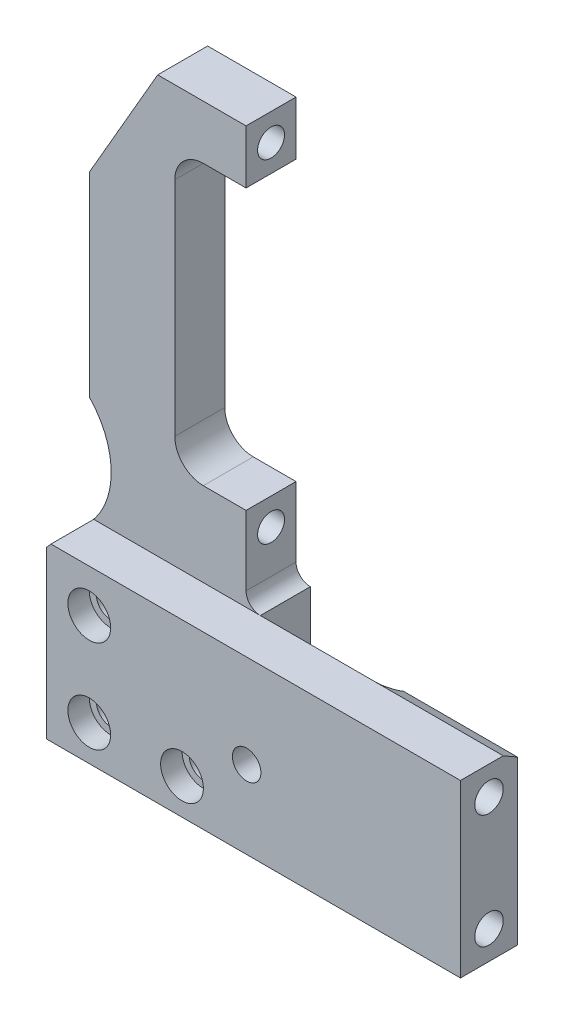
ISO-10303-21;
HEADER;
FILE_DESCRIPTION(('STEP AP214'),'2;1');
FILE_NAME('part.step','',(''),(''),'','','');
FILE_SCHEMA(('AUTOMOTIVE_DESIGN { 1 0 10303 214 1 1 1 1 }'));
ENDSEC;
DATA;
#1=APPLICATION_CONTEXT('core data for automotive mechanical design processes');
#2=APPLICATION_PROTOCOL_DEFINITION('international standard','automotive_design',2000,#1);
#3=PRODUCT_CONTEXT('',#1,'mechanical');
#4=PRODUCT('Part','Part','',(#3));
#5=PRODUCT_RELATED_PRODUCT_CATEGORY('part','',(#4));
#6=PRODUCT_DEFINITION_FORMATION('','',#4);
#7=PRODUCT_DEFINITION_CONTEXT('part definition',#1,'design');
#8=PRODUCT_DEFINITION('design','',#6,#7);
#9=PRODUCT_DEFINITION_SHAPE('','',#8);
#10=(LENGTH_UNIT() NAMED_UNIT(*) SI_UNIT(.MILLI.,.METRE.));
#11=(NAMED_UNIT(*) PLANE_ANGLE_UNIT() SI_UNIT($,.RADIAN.));
#12=(NAMED_UNIT(*) SI_UNIT($,.STERADIAN.) SOLID_ANGLE_UNIT());
#13=UNCERTAINTY_MEASURE_WITH_UNIT(LENGTH_MEASURE(1.E-05),#10,'distance_accuracy_value','');
#14=(GEOMETRIC_REPRESENTATION_CONTEXT(3) GLOBAL_UNCERTAINTY_ASSIGNED_CONTEXT((#13)) GLOBAL_UNIT_ASSIGNED_CONTEXT((#10,
#11,#12)) REPRESENTATION_CONTEXT('',''));
#15=CARTESIAN_POINT('',(0.,0.,0.));
#16=DIRECTION('',(0.,0.,1.));
#17=DIRECTION('',(1.,0.,0.));
#18=AXIS2_PLACEMENT_3D('',#15,#16,#17);
#19=CARTESIAN_POINT('',(57.15,-31.75,-10.3124));
#20=DIRECTION('',(0.,0.,1.));
#21=DIRECTION('',(1.,0.,0.));
#22=AXIS2_PLACEMENT_3D('',#19,#20,#21);
#23=CYLINDRICAL_SURFACE('',#22,3.175);
#24=CARTESIAN_POINT('',(57.15,-31.75,15.0876));
#25=DIRECTION('',(0.,0.,1.));
#26=DIRECTION('',(1.,0.,0.));
#27=AXIS2_PLACEMENT_3D('',#24,#25,#26);
#28=CIRCLE('',#27,3.175);
#29=CARTESIAN_POINT('',(60.325,-31.75,15.0876));
#30=VERTEX_POINT('',#29);
#31=EDGE_CURVE('E129',#30,#30,#28,.T.);
#32=ORIENTED_EDGE('',*,*,#31,.T.);
#33=EDGE_LOOP('',(#32));
#34=FACE_BOUND('',#33,.T.);
#35=CARTESIAN_POINT('',(57.15,-31.75,10.3378));
#36=DIRECTION('',(0.,0.,-1.));
#37=DIRECTION('',(-1.,0.,0.));
#38=AXIS2_PLACEMENT_3D('',#35,#36,#37);
#39=CIRCLE('',#38,3.175);
#40=CARTESIAN_POINT('',(53.975,-31.75,10.3378));
#41=VERTEX_POINT('',#40);
#42=EDGE_CURVE('E57',#41,#41,#39,.F.);
#43=ORIENTED_EDGE('',*,*,#42,.F.);
#44=EDGE_LOOP('',(#43));
#45=FACE_BOUND('',#44,.T.);
#46=ADVANCED_FACE('F53',(#34,#45),#23,.F.);
#47=CARTESIAN_POINT('',(22.098,-41.1734,-19.05));
#48=DIRECTION('',(0.,0.,1.));
#49=DIRECTION('',(1.,0.,0.));
#50=AXIS2_PLACEMENT_3D('',#47,#48,#49);
#51=CYLINDRICAL_SURFACE('',#50,3.175);
#52=CARTESIAN_POINT('',(22.098,-41.1734,5.5626));
#53=DIRECTION('',(0.,0.,-1.));
#54=DIRECTION('',(-1.,0.,0.));
#55=AXIS2_PLACEMENT_3D('',#52,#53,#54);
#56=CIRCLE('',#55,3.175);
#57=CARTESIAN_POINT('',(25.273,-41.1734,5.5626));
#58=VERTEX_POINT('',#57);
#59=EDGE_CURVE('E155',#58,#58,#56,.T.);
#60=CARTESIAN_POINT('',(22.098,-41.1734,10.3124));
#61=DIRECTION('',(0.,0.,1.));
#62=DIRECTION('',(1.,0.,0.));
#63=AXIS2_PLACEMENT_3D('',#60,#61,#62);
#64=CIRCLE('',#63,3.175);
#65=CARTESIAN_POINT('',(25.273,-41.1734,10.3124));
#66=VERTEX_POINT('',#65);
#67=EDGE_CURVE('E209',#66,#66,#64,.F.);
#68=CARTESIAN_POINT('',(25.273,-41.1734,5.5626));
#69=CARTESIAN_POINT('',(25.273,-41.1734,5.61207708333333));
#70=CARTESIAN_POINT('',(25.273,-41.1734,5.66155416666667));
#71=CARTESIAN_POINT('',(25.273,-41.1734,5.76050833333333));
#72=CARTESIAN_POINT('',(25.273,-41.1734,5.80998541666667));
#73=CARTESIAN_POINT('',(25.273,-41.1734,5.90893958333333));
#74=CARTESIAN_POINT('',(25.273,-41.1734,5.95841666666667));
#75=CARTESIAN_POINT('',(25.273,-41.1734,6.05737083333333));
#76=CARTESIAN_POINT('',(25.273,-41.1734,6.10684791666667));
#77=CARTESIAN_POINT('',(25.273,-41.1734,6.20580208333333));
#78=CARTESIAN_POINT('',(25.273,-41.1734,6.25527916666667));
#79=CARTESIAN_POINT('',(25.273,-41.1734,6.35423333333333));
#80=CARTESIAN_POINT('',(25.273,-41.1734,6.40371041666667));
#81=CARTESIAN_POINT('',(25.273,-41.1734,6.50266458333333));
#82=CARTESIAN_POINT('',(25.273,-41.1734,6.55214166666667));
#83=CARTESIAN_POINT('',(25.273,-41.1734,6.65109583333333));
#84=CARTESIAN_POINT('',(25.273,-41.1734,6.70057291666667));
#85=CARTESIAN_POINT('',(25.273,-41.1734,6.79952708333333));
#86=CARTESIAN_POINT('',(25.273,-41.1734,6.84900416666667));
#87=CARTESIAN_POINT('',(25.273,-41.1734,6.94795833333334));
#88=CARTESIAN_POINT('',(25.273,-41.1734,6.99743541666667));
#89=CARTESIAN_POINT('',(25.273,-41.1734,7.09638958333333));
#90=CARTESIAN_POINT('',(25.273,-41.1734,7.14586666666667));
#91=CARTESIAN_POINT('',(25.273,-41.1734,7.24482083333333));
#92=CARTESIAN_POINT('',(25.273,-41.1734,7.29429791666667));
#93=CARTESIAN_POINT('',(25.273,-41.1734,7.39325208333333));
#94=CARTESIAN_POINT('',(25.273,-41.1734,7.44272916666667));
#95=CARTESIAN_POINT('',(25.273,-41.1734,7.54168333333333));
#96=CARTESIAN_POINT('',(25.273,-41.1734,7.59116041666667));
#97=CARTESIAN_POINT('',(25.273,-41.1734,7.69011458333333));
#98=CARTESIAN_POINT('',(25.273,-41.1734,7.73959166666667));
#99=CARTESIAN_POINT('',(25.273,-41.1734,7.83854583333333));
#100=CARTESIAN_POINT('',(25.273,-41.1734,7.88802291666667));
#101=CARTESIAN_POINT('',(25.273,-41.1734,7.98697708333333));
#102=CARTESIAN_POINT('',(25.273,-41.1734,8.03645416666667));
#103=CARTESIAN_POINT('',(25.273,-41.1734,8.13540833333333));
#104=CARTESIAN_POINT('',(25.273,-41.1734,8.18488541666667));
#105=CARTESIAN_POINT('',(25.273,-41.1734,8.28383958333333));
#106=CARTESIAN_POINT('',(25.273,-41.1734,8.33331666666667));
#107=CARTESIAN_POINT('',(25.273,-41.1734,8.43227083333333));
#108=CARTESIAN_POINT('',(25.273,-41.1734,8.48174791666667));
#109=CARTESIAN_POINT('',(25.273,-41.1734,8.58070208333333));
#110=CARTESIAN_POINT('',(25.273,-41.1734,8.63017916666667));
#111=CARTESIAN_POINT('',(25.273,-41.1734,8.72913333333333));
#112=CARTESIAN_POINT('',(25.273,-41.1734,8.77861041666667));
#113=CARTESIAN_POINT('',(25.273,-41.1734,8.87756458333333));
#114=CARTESIAN_POINT('',(25.273,-41.1734,8.92704166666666));
#115=CARTESIAN_POINT('',(25.273,-41.1734,9.02599583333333));
#116=CARTESIAN_POINT('',(25.273,-41.1734,9.07547291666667));
#117=CARTESIAN_POINT('',(25.273,-41.1734,9.17442708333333));
#118=CARTESIAN_POINT('',(25.273,-41.1734,9.22390416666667));
#119=CARTESIAN_POINT('',(25.273,-41.1734,9.32285833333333));
#120=CARTESIAN_POINT('',(25.273,-41.1734,9.37233541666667));
#121=CARTESIAN_POINT('',(25.273,-41.1734,9.47128958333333));
#122=CARTESIAN_POINT('',(25.273,-41.1734,9.52076666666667));
#123=CARTESIAN_POINT('',(25.273,-41.1734,9.61972083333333));
#124=CARTESIAN_POINT('',(25.273,-41.1734,9.66919791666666));
#125=CARTESIAN_POINT('',(25.273,-41.1734,9.76815208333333));
#126=CARTESIAN_POINT('',(25.273,-41.1734,9.81762916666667));
#127=CARTESIAN_POINT('',(25.273,-41.1734,9.91658333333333));
#128=CARTESIAN_POINT('',(25.273,-41.1734,9.96606041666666));
#129=CARTESIAN_POINT('',(25.273,-41.1734,10.0650145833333));
#130=CARTESIAN_POINT('',(25.273,-41.1734,10.1144916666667));
#131=CARTESIAN_POINT('',(25.273,-41.1734,10.2134458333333));
#132=CARTESIAN_POINT('',(25.273,-41.1734,10.2629229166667));
#133=CARTESIAN_POINT('',(25.273,-41.1734,10.3124));
#134=B_SPLINE_CURVE_WITH_KNOTS('',3,(#68,#69,#70,#71,#72,#73,#74,#75,#76,#77,#78,#79,#80,#81,
#82,#83,#84,#85,#86,#87,#88,#89,#90,#91,#92,#93,#94,#95,#96,#97,#98,#99,#100,#101,#102,#103,
#104,#105,#106,#107,#108,#109,#110,#111,#112,#113,#114,#115,#116,#117,#118,#119,#120,#121,#122,
#123,#124,#125,#126,#127,#128,#129,#130,#131,#132,#133),.UNSPECIFIED.,.F.,.F.,(4,2,2,2,2,2,2,2,
2,2,2,2,2,2,2,2,2,2,2,2,2,2,2,2,2,2,2,2,2,2,2,2,4),(0.,0.148431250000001,0.296862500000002,
0.445293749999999,0.593725,0.742156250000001,0.890587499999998,1.03901875,1.18745,1.33588125,
1.4843125,1.63274375,1.781175,1.92960625,2.0780375,2.22646875,2.3749,2.52333125,2.6717625,
2.82019375,2.968625,3.11705625,3.2654875,3.41391875,3.56235,3.71078125,3.8592125,4.00764375,
4.156075,4.30450625,4.4529375,4.60136875,4.7498),.UNSPECIFIED.);
#135=EDGE_CURVE('BSEAM231',#58,#66,#134,.T.);
#136=ORIENTED_EDGE('',*,*,#59,.T.);
#137=ORIENTED_EDGE('',*,*,#67,.F.);
#138=ORIENTED_EDGE('',*,*,#135,.T.);
#139=ORIENTED_EDGE('',*,*,#135,.F.);
#140=EDGE_LOOP('',(#136,#138,#137,#139));
#141=FACE_BOUND('',#140,.T.);
#142=ADVANCED_FACE('F231',(#141),#51,.F.);
#143=CARTESIAN_POINT('',(42.7482,-41.1734,-19.05));
#144=DIRECTION('',(0.,0.,1.));
#145=DIRECTION('',(1.,0.,0.));
#146=AXIS2_PLACEMENT_3D('',#143,#144,#145);
#147=CYLINDRICAL_SURFACE('',#146,3.175);
#148=CARTESIAN_POINT('',(42.7482,-41.1734,5.5626));
#149=DIRECTION('',(0.,0.,-1.));
#150=DIRECTION('',(-1.,0.,0.));
#151=AXIS2_PLACEMENT_3D('',#148,#149,#150);
#152=CIRCLE('',#151,3.175);
#153=CARTESIAN_POINT('',(45.9232,-41.1734,5.5626));
#154=VERTEX_POINT('',#153);
#155=EDGE_CURVE('E158',#154,#154,#152,.T.);
#156=CARTESIAN_POINT('',(42.7482,-41.1734,10.3124));
#157=DIRECTION('',(0.,0.,1.));
#158=DIRECTION('',(1.,0.,0.));
#159=AXIS2_PLACEMENT_3D('',#156,#157,#158);
#160=CIRCLE('',#159,3.175);
#161=CARTESIAN_POINT('',(45.9232,-41.1734,10.3124));
#162=VERTEX_POINT('',#161);
#163=EDGE_CURVE('E202',#162,#162,#160,.F.);
#164=CARTESIAN_POINT('',(45.9232,-41.1734,5.5626));
#165=CARTESIAN_POINT('',(45.9232,-41.1734,5.61207708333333));
#166=CARTESIAN_POINT('',(45.9232,-41.1734,5.66155416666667));
#167=CARTESIAN_POINT('',(45.9232,-41.1734,5.76050833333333));
#168=CARTESIAN_POINT('',(45.9232,-41.1734,5.80998541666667));
#169=CARTESIAN_POINT('',(45.9232,-41.1734,5.90893958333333));
#170=CARTESIAN_POINT('',(45.9232,-41.1734,5.95841666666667));
#171=CARTESIAN_POINT('',(45.9232,-41.1734,6.05737083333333));
#172=CARTESIAN_POINT('',(45.9232,-41.1734,6.10684791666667));
#173=CARTESIAN_POINT('',(45.9232,-41.1734,6.20580208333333));
#174=CARTESIAN_POINT('',(45.9232,-41.1734,6.25527916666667));
#175=CARTESIAN_POINT('',(45.9232,-41.1734,6.35423333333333));
#176=CARTESIAN_POINT('',(45.9232,-41.1734,6.40371041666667));
#177=CARTESIAN_POINT('',(45.9232,-41.1734,6.50266458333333));
#178=CARTESIAN_POINT('',(45.9232,-41.1734,6.55214166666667));
#179=CARTESIAN_POINT('',(45.9232,-41.1734,6.65109583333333));
#180=CARTESIAN_POINT('',(45.9232,-41.1734,6.70057291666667));
#181=CARTESIAN_POINT('',(45.9232,-41.1734,6.79952708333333));
#182=CARTESIAN_POINT('',(45.9232,-41.1734,6.84900416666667));
#183=CARTESIAN_POINT('',(45.9232,-41.1734,6.94795833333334));
#184=CARTESIAN_POINT('',(45.9232,-41.1734,6.99743541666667));
#185=CARTESIAN_POINT('',(45.9232,-41.1734,7.09638958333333));
#186=CARTESIAN_POINT('',(45.9232,-41.1734,7.14586666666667));
#187=CARTESIAN_POINT('',(45.9232,-41.1734,7.24482083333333));
#188=CARTESIAN_POINT('',(45.9232,-41.1734,7.29429791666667));
#189=CARTESIAN_POINT('',(45.9232,-41.1734,7.39325208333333));
#190=CARTESIAN_POINT('',(45.9232,-41.1734,7.44272916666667));
#191=CARTESIAN_POINT('',(45.9232,-41.1734,7.54168333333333));
#192=CARTESIAN_POINT('',(45.9232,-41.1734,7.59116041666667));
#193=CARTESIAN_POINT('',(45.9232,-41.1734,7.69011458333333));
#194=CARTESIAN_POINT('',(45.9232,-41.1734,7.73959166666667));
#195=CARTESIAN_POINT('',(45.9232,-41.1734,7.83854583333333));
#196=CARTESIAN_POINT('',(45.9232,-41.1734,7.88802291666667));
#197=CARTESIAN_POINT('',(45.9232,-41.1734,7.98697708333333));
#198=CARTESIAN_POINT('',(45.9232,-41.1734,8.03645416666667));
#199=CARTESIAN_POINT('',(45.9232,-41.1734,8.13540833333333));
#200=CARTESIAN_POINT('',(45.9232,-41.1734,8.18488541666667));
#201=CARTESIAN_POINT('',(45.9232,-41.1734,8.28383958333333));
#202=CARTESIAN_POINT('',(45.9232,-41.1734,8.33331666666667));
#203=CARTESIAN_POINT('',(45.9232,-41.1734,8.43227083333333));
#204=CARTESIAN_POINT('',(45.9232,-41.1734,8.48174791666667));
#205=CARTESIAN_POINT('',(45.9232,-41.1734,8.58070208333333));
#206=CARTESIAN_POINT('',(45.9232,-41.1734,8.63017916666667));
#207=CARTESIAN_POINT('',(45.9232,-41.1734,8.72913333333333));
#208=CARTESIAN_POINT('',(45.9232,-41.1734,8.77861041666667));
#209=CARTESIAN_POINT('',(45.9232,-41.1734,8.87756458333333));
#210=CARTESIAN_POINT('',(45.9232,-41.1734,8.92704166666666));
#211=CARTESIAN_POINT('',(45.9232,-41.1734,9.02599583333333));
#212=CARTESIAN_POINT('',(45.9232,-41.1734,9.07547291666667));
#213=CARTESIAN_POINT('',(45.9232,-41.1734,9.17442708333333));
#214=CARTESIAN_POINT('',(45.9232,-41.1734,9.22390416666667));
#215=CARTESIAN_POINT('',(45.9232,-41.1734,9.32285833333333));
#216=CARTESIAN_POINT('',(45.9232,-41.1734,9.37233541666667));
#217=CARTESIAN_POINT('',(45.9232,-41.1734,9.47128958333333));
#218=CARTESIAN_POINT('',(45.9232,-41.1734,9.52076666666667));
#219=CARTESIAN_POINT('',(45.9232,-41.1734,9.61972083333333));
#220=CARTESIAN_POINT('',(45.9232,-41.1734,9.66919791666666));
#221=CARTESIAN_POINT('',(45.9232,-41.1734,9.76815208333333));
#222=CARTESIAN_POINT('',(45.9232,-41.1734,9.81762916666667));
#223=CARTESIAN_POINT('',(45.9232,-41.1734,9.91658333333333));
#224=CARTESIAN_POINT('',(45.9232,-41.1734,9.96606041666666));
#225=CARTESIAN_POINT('',(45.9232,-41.1734,10.0650145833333));
#226=CARTESIAN_POINT('',(45.9232,-41.1734,10.1144916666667));
#227=CARTESIAN_POINT('',(45.9232,-41.1734,10.2134458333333));
#228=CARTESIAN_POINT('',(45.9232,-41.1734,10.2629229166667));
#229=CARTESIAN_POINT('',(45.9232,-41.1734,10.3124));
#230=B_SPLINE_CURVE_WITH_KNOTS('',3,(#164,#165,#166,#167,#168,#169,#170,#171,#172,#173,#174,
#175,#176,#177,#178,#179,#180,#181,#182,#183,#184,#185,#186,#187,#188,#189,#190,#191,#192,#193,
#194,#195,#196,#197,#198,#199,#200,#201,#202,#203,#204,#205,#206,#207,#208,#209,#210,#211,#212,
#213,#214,#215,#216,#217,#218,#219,#220,#221,#222,#223,#224,#225,#226,#227,#228,#229),
.UNSPECIFIED.,.F.,.F.,(4,2,2,2,2,2,2,2,2,2,2,2,2,2,2,2,2,2,2,2,2,2,2,2,2,2,2,2,2,2,2,2,4),(0.,
0.148431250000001,0.296862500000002,0.445293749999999,0.593725,0.742156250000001,
0.890587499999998,1.03901875,1.18745,1.33588125,1.4843125,1.63274375,1.781175,1.92960625,
2.0780375,2.22646875,2.3749,2.52333125,2.6717625,2.82019375,2.968625,3.11705625,3.2654875,
3.41391875,3.56235,3.71078125,3.8592125,4.00764375,4.156075,4.30450625,4.4529375,4.60136875,
4.7498),.UNSPECIFIED.);
#231=EDGE_CURVE('BSEAM237',#154,#162,#230,.T.);
#232=ORIENTED_EDGE('',*,*,#155,.T.);
#233=ORIENTED_EDGE('',*,*,#163,.F.);
#234=ORIENTED_EDGE('',*,*,#231,.T.);
#235=ORIENTED_EDGE('',*,*,#231,.F.);
#236=EDGE_LOOP('',(#232,#234,#233,#235));
#237=FACE_BOUND('',#236,.T.);
#238=ADVANCED_FACE('F237',(#237),#147,.F.);
#239=CARTESIAN_POINT('',(22.098,-20.5232,-19.05));
#240=DIRECTION('',(0.,0.,1.));
#241=DIRECTION('',(1.,0.,0.));
#242=AXIS2_PLACEMENT_3D('',#239,#240,#241);
#243=CYLINDRICAL_SURFACE('',#242,3.17499999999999);
#244=CARTESIAN_POINT('',(22.098,-20.5232,5.5626));
#245=DIRECTION('',(0.,0.,-1.));
#246=DIRECTION('',(-1.,0.,0.));
#247=AXIS2_PLACEMENT_3D('',#244,#245,#246);
#248=CIRCLE('',#247,3.17499999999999);
#249=CARTESIAN_POINT('',(25.273,-20.5232,5.5626));
#250=VERTEX_POINT('',#249);
#251=EDGE_CURVE('E162',#250,#250,#248,.T.);
#252=CARTESIAN_POINT('',(22.098,-20.5232,10.3124));
#253=DIRECTION('',(0.,0.,1.));
#254=DIRECTION('',(1.,0.,0.));
#255=AXIS2_PLACEMENT_3D('',#252,#253,#254);
#256=CIRCLE('',#255,3.17499999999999);
#257=CARTESIAN_POINT('',(25.273,-20.5232,10.3124));
#258=VERTEX_POINT('',#257);
#259=EDGE_CURVE('E197',#258,#258,#256,.F.);
#260=CARTESIAN_POINT('',(25.273,-20.5232,5.5626));
#261=CARTESIAN_POINT('',(25.273,-20.5232,5.61207708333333));
#262=CARTESIAN_POINT('',(25.273,-20.5232,5.66155416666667));
#263=CARTESIAN_POINT('',(25.273,-20.5232,5.76050833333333));
#264=CARTESIAN_POINT('',(25.273,-20.5232,5.80998541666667));
#265=CARTESIAN_POINT('',(25.273,-20.5232,5.90893958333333));
#266=CARTESIAN_POINT('',(25.273,-20.5232,5.95841666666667));
#267=CARTESIAN_POINT('',(25.273,-20.5232,6.05737083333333));
#268=CARTESIAN_POINT('',(25.273,-20.5232,6.10684791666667));
#269=CARTESIAN_POINT('',(25.273,-20.5232,6.20580208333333));
#270=CARTESIAN_POINT('',(25.273,-20.5232,6.25527916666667));
#271=CARTESIAN_POINT('',(25.273,-20.5232,6.35423333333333));
#272=CARTESIAN_POINT('',(25.273,-20.5232,6.40371041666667));
#273=CARTESIAN_POINT('',(25.273,-20.5232,6.50266458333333));
#274=CARTESIAN_POINT('',(25.273,-20.5232,6.55214166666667));
#275=CARTESIAN_POINT('',(25.273,-20.5232,6.65109583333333));
#276=CARTESIAN_POINT('',(25.273,-20.5232,6.70057291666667));
#277=CARTESIAN_POINT('',(25.273,-20.5232,6.79952708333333));
#278=CARTESIAN_POINT('',(25.273,-20.5232,6.84900416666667));
#279=CARTESIAN_POINT('',(25.273,-20.5232,6.94795833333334));
#280=CARTESIAN_POINT('',(25.273,-20.5232,6.99743541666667));
#281=CARTESIAN_POINT('',(25.273,-20.5232,7.09638958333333));
#282=CARTESIAN_POINT('',(25.273,-20.5232,7.14586666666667));
#283=CARTESIAN_POINT('',(25.273,-20.5232,7.24482083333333));
#284=CARTESIAN_POINT('',(25.273,-20.5232,7.29429791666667));
#285=CARTESIAN_POINT('',(25.273,-20.5232,7.39325208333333));
#286=CARTESIAN_POINT('',(25.273,-20.5232,7.44272916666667));
#287=CARTESIAN_POINT('',(25.273,-20.5232,7.54168333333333));
#288=CARTESIAN_POINT('',(25.273,-20.5232,7.59116041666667));
#289=CARTESIAN_POINT('',(25.273,-20.5232,7.69011458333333));
#290=CARTESIAN_POINT('',(25.273,-20.5232,7.73959166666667));
#291=CARTESIAN_POINT('',(25.273,-20.5232,7.83854583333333));
#292=CARTESIAN_POINT('',(25.273,-20.5232,7.88802291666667));
#293=CARTESIAN_POINT('',(25.273,-20.5232,7.98697708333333));
#294=CARTESIAN_POINT('',(25.273,-20.5232,8.03645416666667));
#295=CARTESIAN_POINT('',(25.273,-20.5232,8.13540833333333));
#296=CARTESIAN_POINT('',(25.273,-20.5232,8.18488541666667));
#297=CARTESIAN_POINT('',(25.273,-20.5232,8.28383958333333));
#298=CARTESIAN_POINT('',(25.273,-20.5232,8.33331666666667));
#299=CARTESIAN_POINT('',(25.273,-20.5232,8.43227083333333));
#300=CARTESIAN_POINT('',(25.273,-20.5232,8.48174791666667));
#301=CARTESIAN_POINT('',(25.273,-20.5232,8.58070208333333));
#302=CARTESIAN_POINT('',(25.273,-20.5232,8.63017916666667));
#303=CARTESIAN_POINT('',(25.273,-20.5232,8.72913333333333));
#304=CARTESIAN_POINT('',(25.273,-20.5232,8.77861041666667));
#305=CARTESIAN_POINT('',(25.273,-20.5232,8.87756458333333));
#306=CARTESIAN_POINT('',(25.273,-20.5232,8.92704166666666));
#307=CARTESIAN_POINT('',(25.273,-20.5232,9.02599583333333));
#308=CARTESIAN_POINT('',(25.273,-20.5232,9.07547291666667));
#309=CARTESIAN_POINT('',(25.273,-20.5232,9.17442708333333));
#310=CARTESIAN_POINT('',(25.273,-20.5232,9.22390416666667));
#311=CARTESIAN_POINT('',(25.273,-20.5232,9.32285833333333));
#312=CARTESIAN_POINT('',(25.273,-20.5232,9.37233541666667));
#313=CARTESIAN_POINT('',(25.273,-20.5232,9.47128958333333));
#314=CARTESIAN_POINT('',(25.273,-20.5232,9.52076666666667));
#315=CARTESIAN_POINT('',(25.273,-20.5232,9.61972083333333));
#316=CARTESIAN_POINT('',(25.273,-20.5232,9.66919791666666));
#317=CARTESIAN_POINT('',(25.273,-20.5232,9.76815208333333));
#318=CARTESIAN_POINT('',(25.273,-20.5232,9.81762916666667));
#319=CARTESIAN_POINT('',(25.273,-20.5232,9.91658333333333));
#320=CARTESIAN_POINT('',(25.273,-20.5232,9.96606041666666));
#321=CARTESIAN_POINT('',(25.273,-20.5232,10.0650145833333));
#322=CARTESIAN_POINT('',(25.273,-20.5232,10.1144916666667));
#323=CARTESIAN_POINT('',(25.273,-20.5232,10.2134458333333));
#324=CARTESIAN_POINT('',(25.273,-20.5232,10.2629229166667));
#325=CARTESIAN_POINT('',(25.273,-20.5232,10.3124));
#326=B_SPLINE_CURVE_WITH_KNOTS('',3,(#260,#261,#262,#263,#264,#265,#266,#267,#268,#269,#270,
#271,#272,#273,#274,#275,#276,#277,#278,#279,#280,#281,#282,#283,#284,#285,#286,#287,#288,#289,
#290,#291,#292,#293,#294,#295,#296,#297,#298,#299,#300,#301,#302,#303,#304,#305,#306,#307,#308,
#309,#310,#311,#312,#313,#314,#315,#316,#317,#318,#319,#320,#321,#322,#323,#324,#325),
.UNSPECIFIED.,.F.,.F.,(4,2,2,2,2,2,2,2,2,2,2,2,2,2,2,2,2,2,2,2,2,2,2,2,2,2,2,2,2,2,2,2,4),(0.,
0.148431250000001,0.296862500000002,0.445293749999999,0.593725,0.742156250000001,
0.890587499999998,1.03901875,1.18745,1.33588125,1.4843125,1.63274375,1.781175,1.92960625,
2.0780375,2.22646875,2.3749,2.52333125,2.6717625,2.82019375,2.968625,3.11705625,3.2654875,
3.41391875,3.56235,3.71078125,3.8592125,4.00764375,4.156075,4.30450625,4.4529375,4.60136875,
4.7498),.UNSPECIFIED.);
#327=EDGE_CURVE('BSEAM268',#250,#258,#326,.T.);
#328=ORIENTED_EDGE('',*,*,#251,.T.);
#329=ORIENTED_EDGE('',*,*,#259,.F.);
#330=ORIENTED_EDGE('',*,*,#327,.T.);
#331=ORIENTED_EDGE('',*,*,#327,.F.);
#332=EDGE_LOOP('',(#328,#330,#329,#331));
#333=FACE_BOUND('',#332,.T.);
#334=ADVANCED_FACE('F268',(#333),#243,.F.);
#335=CARTESIAN_POINT('',(104.775,-49.0982,15.0876));
#336=DIRECTION('',(0.,1.,0.));
#337=DIRECTION('',(0.,0.,1.));
#338=AXIS2_PLACEMENT_3D('',#335,#336,#337);
#339=PLANE('',#338);
#340=DIRECTION('',(1.,0.,0.));
#341=VECTOR('',#340,1.);
#342=CARTESIAN_POINT('',(104.775,-49.0982,5.5626));
#343=LINE('',#342,#341);
#344=CARTESIAN_POINT('',(12.5729999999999,-49.0982,5.5626));
#345=VERTEX_POINT('',#344);
#346=CARTESIAN_POINT('',(76.2,-49.0982,5.5626));
#347=VERTEX_POINT('',#346);
#348=EDGE_CURVE('E135',#345,#347,#343,.T.);
#349=ORIENTED_EDGE('',*,*,#348,.T.);
#350=CARTESIAN_POINT('',(76.2,-49.0982,2.3876));
#351=DIRECTION('',(0.,1.,0.));
#352=DIRECTION('',(0.,0.,1.));
#353=AXIS2_PLACEMENT_3D('',#350,#351,#352);
#354=CIRCLE('',#353,3.175);
#355=CARTESIAN_POINT('',(79.375,-49.0982,2.3876));
#356=VERTEX_POINT('',#355);
#357=EDGE_CURVE('E303',#347,#356,#354,.T.);
#358=ORIENTED_EDGE('',*,*,#357,.T.);
#359=DIRECTION('',(-1.,0.,0.));
#360=VECTOR('',#359,1.);
#361=CARTESIAN_POINT('',(79.375,-49.0982,2.3876));
#362=LINE('',#361,#360);
#363=CARTESIAN_POINT('',(104.775,-49.0982,2.3876));
#364=VERTEX_POINT('',#363);
#365=EDGE_CURVE('E175',#364,#356,#362,.T.);
#366=ORIENTED_EDGE('',*,*,#365,.F.);
#367=DIRECTION('',(0.,0.,-1.));
#368=VECTOR('',#367,1.);
#369=CARTESIAN_POINT('',(104.775,-49.0982,15.0876));
#370=LINE('',#369,#368);
#371=CARTESIAN_POINT('',(104.775,-49.0982,15.0876));
#372=VERTEX_POINT('',#371);
#373=EDGE_CURVE('E151',#372,#364,#370,.T.);
#374=ORIENTED_EDGE('',*,*,#373,.F.);
#375=DIRECTION('',(1.,0.,0.));
#376=VECTOR('',#375,1.);
#377=CARTESIAN_POINT('',(104.775,-49.0982,15.0876));
#378=LINE('',#377,#376);
#379=CARTESIAN_POINT('',(12.5729999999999,-49.0982,15.0876));
#380=VERTEX_POINT('',#379);
#381=EDGE_CURVE('E136',#380,#372,#378,.T.);
#382=ORIENTED_EDGE('',*,*,#381,.F.);
#383=DIRECTION('',(0.,0.,-1.));
#384=VECTOR('',#383,1.);
#385=CARTESIAN_POINT('',(12.5729999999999,-49.0982,15.0876));
#386=LINE('',#385,#384);
#387=EDGE_CURVE('E147',#380,#345,#386,.T.);
#388=ORIENTED_EDGE('',*,*,#387,.T.);
#389=EDGE_LOOP('',(#349,#358,#366,#374,#382,#388));
#390=FACE_BOUND('',#389,.T.);
#391=ADVANCED_FACE('F271',(#390),#339,.F.);
#392=CARTESIAN_POINT('',(104.775,-10.9982,15.0876));
#393=DIRECTION('',(-1.,0.,0.));
#394=DIRECTION('',(0.,0.,1.));
#395=AXIS2_PLACEMENT_3D('',#392,#393,#394);
#396=PLANE('',#395);
#397=CARTESIAN_POINT('',(104.775,-42.7481999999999,8.7376));
#398=DIRECTION('',(1.,0.,0.));
#399=DIRECTION('',(0.,0.,-1.));
#400=AXIS2_PLACEMENT_3D('',#397,#398,#399);
#401=CIRCLE('',#400,3.175);
#402=CARTESIAN_POINT('',(104.775,-42.7481999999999,5.5626));
#403=VERTEX_POINT('',#402);
#404=EDGE_CURVE('E187',#403,#403,#401,.T.);
#405=ORIENTED_EDGE('',*,*,#404,.F.);
#406=EDGE_LOOP('',(#405));
#407=FACE_BOUND('',#406,.T.);
#408=CARTESIAN_POINT('',(104.775,-17.3482,8.7376));
#409=DIRECTION('',(1.,0.,0.));
#410=DIRECTION('',(0.,0.,-1.));
#411=AXIS2_PLACEMENT_3D('',#408,#409,#410);
#412=CIRCLE('',#411,3.175);
#413=CARTESIAN_POINT('',(104.775,-17.3482,5.5626));
#414=VERTEX_POINT('',#413);
#415=EDGE_CURVE('E181',#414,#414,#412,.T.);
#416=ORIENTED_EDGE('',*,*,#415,.F.);
#417=EDGE_LOOP('',(#416));
#418=FACE_BOUND('',#417,.T.);
#419=DIRECTION('',(0.,-1.,0.));
#420=VECTOR('',#419,1.);
#421=CARTESIAN_POINT('',(104.775,-49.0982,2.3876));
#422=LINE('',#421,#420);
#423=CARTESIAN_POINT('',(104.775,-12.8312871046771,2.3876));
#424=VERTEX_POINT('',#423);
#425=EDGE_CURVE('E178',#424,#364,#422,.T.);
#426=ORIENTED_EDGE('',*,*,#425,.F.);
#427=DIRECTION('',(0.,-0.499999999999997,-0.86602540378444));
#428=VECTOR('',#427,1.);
#429=CARTESIAN_POINT('',(104.775,-12.8312871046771,2.3876));
#430=LINE('',#429,#428);
#431=CARTESIAN_POINT('',(104.775,-10.9982,5.56260000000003));
#432=VERTEX_POINT('',#431);
#433=EDGE_CURVE('E77',#424,#432,#430,.F.);
#434=ORIENTED_EDGE('',*,*,#433,.T.);
#435=DIRECTION('',(0.,0.,-1.));
#436=VECTOR('',#435,1.);
#437=CARTESIAN_POINT('',(104.775,-10.9982,15.0876));
#438=LINE('',#437,#436);
#439=CARTESIAN_POINT('',(104.775,-10.9982,15.0876));
#440=VERTEX_POINT('',#439);
#441=EDGE_CURVE('E149',#440,#432,#438,.T.);
#442=ORIENTED_EDGE('',*,*,#441,.F.);
#443=DIRECTION('',(0.,1.,0.));
#444=VECTOR('',#443,1.);
#445=CARTESIAN_POINT('',(104.775,-10.9982,15.0876));
#446=LINE('',#445,#444);
#447=EDGE_CURVE('E140',#372,#440,#446,.T.);
#448=ORIENTED_EDGE('',*,*,#447,.F.);
#449=ORIENTED_EDGE('',*,*,#373,.T.);
#450=EDGE_LOOP('',(#426,#434,#442,#448,#449));
#451=FACE_BOUND('',#450,.T.);
#452=ADVANCED_FACE('F288',(#407,#418,#451),#396,.F.);
#453=CARTESIAN_POINT('',(12.573,-10.9982,15.0876));
#454=DIRECTION('',(0.,-1.,0.));
#455=DIRECTION('',(1.,0.,0.));
#456=AXIS2_PLACEMENT_3D('',#453,#454,#455);
#457=PLANE('',#456);
#458=DIRECTION('',(-1.,0.,0.));
#459=VECTOR('',#458,1.);
#460=CARTESIAN_POINT('',(12.573,-10.9982,5.5626));
#461=LINE('',#460,#459);
#462=CARTESIAN_POINT('',(76.2,-10.9982,5.5626));
#463=VERTEX_POINT('',#462);
#464=CARTESIAN_POINT('',(13.5638675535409,-10.9982,5.5626));
#465=VERTEX_POINT('',#464);
#466=EDGE_CURVE('E137',#463,#465,#461,.T.);
#467=ORIENTED_EDGE('',*,*,#466,.T.);
#468=DIRECTION('',(0.,0.,1.));
#469=VECTOR('',#468,1.);
#470=CARTESIAN_POINT('',(13.5638675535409,-10.9982,-28.2575));
#471=LINE('',#470,#469);
#472=CARTESIAN_POINT('',(13.5638675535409,-10.9982,15.0876));
#473=VERTEX_POINT('',#472);
#474=EDGE_CURVE('E69',#465,#473,#471,.T.);
#475=ORIENTED_EDGE('',*,*,#474,.T.);
#476=DIRECTION('',(-1.,0.,0.));
#477=VECTOR('',#476,1.);
#478=CARTESIAN_POINT('',(12.573,-10.9982,15.0876));
#479=LINE('',#478,#477);
#480=EDGE_CURVE('E169',#440,#473,#479,.T.);
#481=ORIENTED_EDGE('',*,*,#480,.F.);
#482=ORIENTED_EDGE('',*,*,#441,.T.);
#483=DIRECTION('',(-1.,0.,0.));
#484=VECTOR('',#483,1.);
#485=CARTESIAN_POINT('',(12.573,-10.9982,5.56260000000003));
#486=LINE('',#485,#484);
#487=EDGE_CURVE('E307',#432,#463,#486,.T.);
#488=ORIENTED_EDGE('',*,*,#487,.T.);
#489=EDGE_LOOP('',(#467,#475,#481,#482,#488));
#490=FACE_BOUND('',#489,.T.);
#491=ADVANCED_FACE('F285',(#490),#457,.F.);
#492=CARTESIAN_POINT('',(12.5729999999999,-49.0982,15.0876));
#493=DIRECTION('',(1.,0.,0.));
#494=DIRECTION('',(0.,1.,0.));
#495=AXIS2_PLACEMENT_3D('',#492,#493,#494);
#496=PLANE('',#495);
#497=DIRECTION('',(0.,-1.,0.));
#498=VECTOR('',#497,1.);
#499=CARTESIAN_POINT('',(12.5729999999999,-49.0982,15.0876));
#500=LINE('',#499,#498);
#501=CARTESIAN_POINT('',(12.573,-12.1185220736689,15.0876));
#502=VERTEX_POINT('',#501);
#503=EDGE_CURVE('E128',#502,#380,#500,.T.);
#504=ORIENTED_EDGE('',*,*,#503,.F.);
#505=DIRECTION('',(0.,0.,1.));
#506=VECTOR('',#505,1.);
#507=CARTESIAN_POINT('',(12.573,-12.1185220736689,-28.2575));
#508=LINE('',#507,#506);
#509=CARTESIAN_POINT('',(12.573,-12.1185220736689,5.5626));
#510=VERTEX_POINT('',#509);
#511=EDGE_CURVE('E116',#502,#510,#508,.F.);
#512=ORIENTED_EDGE('',*,*,#511,.T.);
#513=DIRECTION('',(0.,-1.,0.));
#514=VECTOR('',#513,1.);
#515=CARTESIAN_POINT('',(12.5729999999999,-49.0982,5.5626));
#516=LINE('',#515,#514);
#517=EDGE_CURVE('E126',#510,#345,#516,.T.);
#518=ORIENTED_EDGE('',*,*,#517,.T.);
#519=ORIENTED_EDGE('',*,*,#387,.F.);
#520=EDGE_LOOP('',(#504,#512,#518,#519));
#521=FACE_BOUND('',#520,.T.);
#522=ADVANCED_FACE('F124',(#521),#496,.F.);
#523=CARTESIAN_POINT('',(0.,0.,15.0876));
#524=DIRECTION('',(0.,0.,-1.));
#525=DIRECTION('',(-1.,0.,0.));
#526=AXIS2_PLACEMENT_3D('',#523,#524,#525);
#527=PLANE('',#526);
#528=CARTESIAN_POINT('',(22.098,-41.1734,15.0876));
#529=DIRECTION('',(0.,0.,1.));
#530=DIRECTION('',(1.,0.,0.));
#531=AXIS2_PLACEMENT_3D('',#528,#529,#530);
#532=CIRCLE('',#531,4.7625);
#533=CARTESIAN_POINT('',(26.8605,-41.1734,15.0876));
#534=VERTEX_POINT('',#533);
#535=EDGE_CURVE('E212',#534,#534,#532,.T.);
#536=ORIENTED_EDGE('',*,*,#535,.F.);
#537=EDGE_LOOP('',(#536));
#538=FACE_BOUND('',#537,.T.);
#539=CARTESIAN_POINT('',(42.7482,-41.1734,15.0876));
#540=DIRECTION('',(0.,0.,1.));
#541=DIRECTION('',(1.,0.,0.));
#542=AXIS2_PLACEMENT_3D('',#539,#540,#541);
#543=CIRCLE('',#542,4.7625);
#544=CARTESIAN_POINT('',(47.5107,-41.1734,15.0876));
#545=VERTEX_POINT('',#544);
#546=EDGE_CURVE('E205',#545,#545,#543,.T.);
#547=ORIENTED_EDGE('',*,*,#546,.F.);
#548=EDGE_LOOP('',(#547));
#549=FACE_BOUND('',#548,.T.);
#550=CARTESIAN_POINT('',(22.098,-20.5232,15.0876));
#551=DIRECTION('',(0.,0.,1.));
#552=DIRECTION('',(1.,0.,0.));
#553=AXIS2_PLACEMENT_3D('',#550,#551,#552);
#554=CIRCLE('',#553,4.7625);
#555=CARTESIAN_POINT('',(26.8605,-20.5232,15.0876));
#556=VERTEX_POINT('',#555);
#557=EDGE_CURVE('E198',#556,#556,#554,.T.);
#558=ORIENTED_EDGE('',*,*,#557,.F.);
#559=EDGE_LOOP('',(#558));
#560=FACE_BOUND('',#559,.T.);
#561=ORIENTED_EDGE('',*,*,#31,.F.);
#562=EDGE_LOOP('',(#561));
#563=FACE_BOUND('',#562,.T.);
#564=ORIENTED_EDGE('',*,*,#480,.T.);
#565=CARTESIAN_POINT('',(0.,0.,15.0876));
#566=DIRECTION('',(0.,0.,-1.));
#567=DIRECTION('',(-1.,0.,0.));
#568=AXIS2_PLACEMENT_3D('',#565,#566,#567);
#569=CIRCLE('',#568,17.4625);
#570=EDGE_CURVE('E190',#473,#502,#569,.T.);
#571=ORIENTED_EDGE('',*,*,#570,.T.);
#572=ORIENTED_EDGE('',*,*,#503,.T.);
#573=ORIENTED_EDGE('',*,*,#381,.T.);
#574=ORIENTED_EDGE('',*,*,#447,.T.);
#575=EDGE_LOOP('',(#564,#571,#572,#573,#574));
#576=FACE_BOUND('',#575,.T.);
#577=ADVANCED_FACE('F276',(#538,#549,#560,#563,#576),#527,.F.);
#578=CARTESIAN_POINT('',(0.,0.,5.5626));
#579=DIRECTION('',(0.,0.,-1.));
#580=DIRECTION('',(-1.,0.,0.));
#581=AXIS2_PLACEMENT_3D('',#578,#579,#580);
#582=PLANE('',#581);
#583=CARTESIAN_POINT('',(57.15,-31.75,5.5626));
#584=DIRECTION('',(0.,0.,-1.));
#585=DIRECTION('',(-1.,0.,0.));
#586=AXIS2_PLACEMENT_3D('',#583,#584,#585);
#587=CIRCLE('',#586,4.7625);
#588=CARTESIAN_POINT('',(52.3875,-31.75,5.5626));
#589=VERTEX_POINT('',#588);
#590=EDGE_CURVE('E218',#589,#589,#587,.T.);
#591=ORIENTED_EDGE('',*,*,#590,.F.);
#592=EDGE_LOOP('',(#591));
#593=FACE_BOUND('',#592,.T.);
#594=CARTESIAN_POINT('',(0.,0.,5.5626));
#595=DIRECTION('',(0.,0.,-1.));
#596=DIRECTION('',(-1.,0.,0.));
#597=AXIS2_PLACEMENT_3D('',#594,#595,#596);
#598=CIRCLE('',#597,17.4625);
#599=EDGE_CURVE('E12',#465,#510,#598,.T.);
#600=ORIENTED_EDGE('',*,*,#599,.F.);
#601=ORIENTED_EDGE('',*,*,#466,.F.);
#602=DIRECTION('',(0.,1.,0.));
#603=VECTOR('',#602,1.);
#604=CARTESIAN_POINT('',(76.2,0.,5.5626));
#605=LINE('',#604,#603);
#606=EDGE_CURVE('E154',#463,#347,#605,.F.);
#607=ORIENTED_EDGE('',*,*,#606,.T.);
#608=ORIENTED_EDGE('',*,*,#348,.F.);
#609=ORIENTED_EDGE('',*,*,#517,.F.);
#610=EDGE_LOOP('',(#600,#601,#607,#608,#609));
#611=FACE_BOUND('',#610,.T.);
#612=ORIENTED_EDGE('',*,*,#251,.F.);
#613=EDGE_LOOP('',(#612));
#614=FACE_BOUND('',#613,.T.);
#615=ORIENTED_EDGE('',*,*,#155,.F.);
#616=EDGE_LOOP('',(#615));
#617=FACE_BOUND('',#616,.T.);
#618=ORIENTED_EDGE('',*,*,#59,.F.);
#619=EDGE_LOOP('',(#618));
#620=FACE_BOUND('',#619,.T.);
#621=ADVANCED_FACE('F132',(#593,#611,#614,#617,#620),#582,.T.);
#622=CARTESIAN_POINT('',(0.,0.,2.3876));
#623=DIRECTION('',(0.,0.,1.));
#624=DIRECTION('',(1.,0.,0.));
#625=AXIS2_PLACEMENT_3D('',#622,#623,#624);
#626=PLANE('',#625);
#627=DIRECTION('',(0.,1.,0.));
#628=VECTOR('',#627,1.);
#629=CARTESIAN_POINT('',(79.375,-10.9982,2.3876));
#630=LINE('',#629,#628);
#631=CARTESIAN_POINT('',(79.375,-12.8312871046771,2.3876));
#632=VERTEX_POINT('',#631);
#633=EDGE_CURVE('E159',#356,#632,#630,.T.);
#634=ORIENTED_EDGE('',*,*,#633,.T.);
#635=DIRECTION('',(1.,0.,0.));
#636=VECTOR('',#635,1.);
#637=CARTESIAN_POINT('',(0.,-12.8312871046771,2.3876));
#638=LINE('',#637,#636);
#639=EDGE_CURVE('E309',#632,#424,#638,.T.);
#640=ORIENTED_EDGE('',*,*,#639,.T.);
#641=ORIENTED_EDGE('',*,*,#425,.T.);
#642=ORIENTED_EDGE('',*,*,#365,.T.);
#643=EDGE_LOOP('',(#634,#640,#641,#642));
#644=FACE_BOUND('',#643,.T.);
#645=ADVANCED_FACE('F264',(#644),#626,.F.);
#646=CARTESIAN_POINT('',(76.2,-10.9982,2.3876));
#647=DIRECTION('',(0.,1.,0.));
#648=DIRECTION('',(0.,0.,1.));
#649=AXIS2_PLACEMENT_3D('',#646,#647,#648);
#650=CYLINDRICAL_SURFACE('',#649,3.175);
#651=ORIENTED_EDGE('',*,*,#606,.F.);
#652=CARTESIAN_POINT('',(76.2,-12.8312871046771,2.3876));
#653=DIRECTION('',(0.,-0.86602540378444,0.499999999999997));
#654=DIRECTION('',(0.,0.499999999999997,0.86602540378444));
#655=AXIS2_PLACEMENT_3D('',#652,#653,#654);
#656=ELLIPSE('',#655,3.66617420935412,3.175);
#657=EDGE_CURVE('E62',#463,#632,#656,.F.);
#658=ORIENTED_EDGE('',*,*,#657,.T.);
#659=ORIENTED_EDGE('',*,*,#633,.F.);
#660=ORIENTED_EDGE('',*,*,#357,.F.);
#661=EDGE_LOOP('',(#651,#658,#659,#660));
#662=FACE_BOUND('',#661,.T.);
#663=ADVANCED_FACE('F262',(#662),#650,.F.);
#664=CARTESIAN_POINT('',(85.725,-17.3482,8.7376));
#665=DIRECTION('',(1.,0.,0.));
#666=DIRECTION('',(0.,0.,-1.));
#667=AXIS2_PLACEMENT_3D('',#664,#665,#666);
#668=CYLINDRICAL_SURFACE('',#667,3.175);
#669=CARTESIAN_POINT('',(85.725,-17.3482,8.7376));
#670=DIRECTION('',(1.,0.,0.));
#671=DIRECTION('',(0.,0.,-1.));
#672=AXIS2_PLACEMENT_3D('',#669,#670,#671);
#673=CIRCLE('',#672,3.175);
#674=CARTESIAN_POINT('',(85.725,-17.3482,5.5626));
#675=VERTEX_POINT('',#674);
#676=EDGE_CURVE('E180',#675,#675,#673,.T.);
#677=CARTESIAN_POINT('',(85.725,-17.3482,5.5626));
#678=CARTESIAN_POINT('',(85.9234375,-17.3482,5.5626));
#679=CARTESIAN_POINT('',(86.121875,-17.3482,5.5626));
#680=CARTESIAN_POINT('',(86.51875,-17.3482,5.5626));
#681=CARTESIAN_POINT('',(86.7171875,-17.3482,5.5626));
#682=CARTESIAN_POINT('',(87.1140625,-17.3482,5.5626));
#683=CARTESIAN_POINT('',(87.3125,-17.3482,5.5626));
#684=CARTESIAN_POINT('',(87.709375,-17.3482,5.5626));
#685=CARTESIAN_POINT('',(87.9078125,-17.3482,5.5626));
#686=CARTESIAN_POINT('',(88.3046875,-17.3482,5.5626));
#687=CARTESIAN_POINT('',(88.503125,-17.3482,5.5626));
#688=CARTESIAN_POINT('',(88.9,-17.3482,5.5626));
#689=CARTESIAN_POINT('',(89.0984375,-17.3482,5.5626));
#690=CARTESIAN_POINT('',(89.4953125,-17.3482,5.5626));
#691=CARTESIAN_POINT('',(89.69375,-17.3482,5.5626));
#692=CARTESIAN_POINT('',(90.090625,-17.3482,5.5626));
#693=CARTESIAN_POINT('',(90.2890625,-17.3482,5.5626));
#694=CARTESIAN_POINT('',(90.6859375,-17.3482,5.5626));
#695=CARTESIAN_POINT('',(90.884375,-17.3482,5.5626));
#696=CARTESIAN_POINT('',(91.28125,-17.3482,5.5626));
#697=CARTESIAN_POINT('',(91.4796875,-17.3482,5.5626));
#698=CARTESIAN_POINT('',(91.8765625,-17.3482,5.5626));
#699=CARTESIAN_POINT('',(92.075,-17.3482,5.5626));
#700=CARTESIAN_POINT('',(92.471875,-17.3482,5.5626));
#701=CARTESIAN_POINT('',(92.6703125,-17.3482,5.5626));
#702=CARTESIAN_POINT('',(93.0671875,-17.3482,5.5626));
#703=CARTESIAN_POINT('',(93.265625,-17.3482,5.5626));
#704=CARTESIAN_POINT('',(93.6625,-17.3482,5.5626));
#705=CARTESIAN_POINT('',(93.8609375,-17.3482,5.5626));
#706=CARTESIAN_POINT('',(94.2578125,-17.3482,5.5626));
#707=CARTESIAN_POINT('',(94.45625,-17.3482,5.5626));
#708=CARTESIAN_POINT('',(94.853125,-17.3482,5.5626));
#709=CARTESIAN_POINT('',(95.0515625,-17.3482,5.5626));
#710=CARTESIAN_POINT('',(95.4484375,-17.3482,5.5626));
#711=CARTESIAN_POINT('',(95.646875,-17.3482,5.5626));
#712=CARTESIAN_POINT('',(96.04375,-17.3482,5.5626));
#713=CARTESIAN_POINT('',(96.2421875,-17.3482,5.5626));
#714=CARTESIAN_POINT('',(96.6390625,-17.3482,5.5626));
#715=CARTESIAN_POINT('',(96.8375,-17.3482,5.5626));
#716=CARTESIAN_POINT('',(97.234375,-17.3482,5.5626));
#717=CARTESIAN_POINT('',(97.4328125,-17.3482,5.5626));
#718=CARTESIAN_POINT('',(97.8296875,-17.3482,5.5626));
#719=CARTESIAN_POINT('',(98.028125,-17.3482,5.5626));
#720=CARTESIAN_POINT('',(98.425,-17.3482,5.5626));
#721=CARTESIAN_POINT('',(98.6234375,-17.3482,5.5626));
#722=CARTESIAN_POINT('',(99.0203125,-17.3482,5.5626));
#723=CARTESIAN_POINT('',(99.21875,-17.3482,5.5626));
#724=CARTESIAN_POINT('',(99.615625,-17.3482,5.5626));
#725=CARTESIAN_POINT('',(99.8140625,-17.3482,5.5626));
#726=CARTESIAN_POINT('',(100.2109375,-17.3482,5.5626));
#727=CARTESIAN_POINT('',(100.409375,-17.3482,5.5626));
#728=CARTESIAN_POINT('',(100.80625,-17.3482,5.5626));
#729=CARTESIAN_POINT('',(101.0046875,-17.3482,5.5626));
#730=CARTESIAN_POINT('',(101.4015625,-17.3482,5.5626));
#731=CARTESIAN_POINT('',(101.6,-17.3482,5.5626));
#732=CARTESIAN_POINT('',(101.996875,-17.3482,5.5626));
#733=CARTESIAN_POINT('',(102.1953125,-17.3482,5.5626));
#734=CARTESIAN_POINT('',(102.5921875,-17.3482,5.5626));
#735=CARTESIAN_POINT('',(102.790625,-17.3482,5.5626));
#736=CARTESIAN_POINT('',(103.1875,-17.3482,5.5626));
#737=CARTESIAN_POINT('',(103.3859375,-17.3482,5.5626));
#738=CARTESIAN_POINT('',(103.7828125,-17.3482,5.5626));
#739=CARTESIAN_POINT('',(103.98125,-17.3482,5.5626));
#740=CARTESIAN_POINT('',(104.378125,-17.3482,5.5626));
#741=CARTESIAN_POINT('',(104.5765625,-17.3482,5.5626));
#742=CARTESIAN_POINT('',(104.775,-17.3482,5.5626));
#743=B_SPLINE_CURVE_WITH_KNOTS('',3,(#677,#678,#679,#680,#681,#682,#683,#684,#685,#686,#687,
#688,#689,#690,#691,#692,#693,#694,#695,#696,#697,#698,#699,#700,#701,#702,#703,#704,#705,#706,
#707,#708,#709,#710,#711,#712,#713,#714,#715,#716,#717,#718,#719,#720,#721,#722,#723,#724,#725,
#726,#727,#728,#729,#730,#731,#732,#733,#734,#735,#736,#737,#738,#739,#740,#741,#742),
.UNSPECIFIED.,.F.,.F.,(4,2,2,2,2,2,2,2,2,2,2,2,2,2,2,2,2,2,2,2,2,2,2,2,2,2,2,2,2,2,2,2,4),(0.,
0.595312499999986,1.19062499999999,1.78593749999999,2.38124999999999,2.97656249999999,
3.57187499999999,4.16718749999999,4.76249999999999,5.35781249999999,5.95312499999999,
6.54843749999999,7.14374999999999,7.73906249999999,8.33437499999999,8.92968749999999,
9.52499999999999,10.1203125,10.715625,11.3109375,11.90625,12.5015625,13.096875,13.6921875,
14.2875,14.8828125,15.478125,16.0734375,16.66875,17.2640625,17.859375,18.4546875,19.05),.UNSPECIFIED.);
#744=EDGE_CURVE('BSEAM258',#675,#414,#743,.T.);
#745=ORIENTED_EDGE('',*,*,#676,.F.);
#746=ORIENTED_EDGE('',*,*,#415,.T.);
#747=ORIENTED_EDGE('',*,*,#744,.T.);
#748=ORIENTED_EDGE('',*,*,#744,.F.);
#749=EDGE_LOOP('',(#745,#747,#746,#748));
#750=FACE_BOUND('',#749,.T.);
#751=ADVANCED_FACE('F258',(#750),#668,.F.);
#752=CARTESIAN_POINT('',(85.725,-17.3482,8.7376));
#753=DIRECTION('',(1.,0.,0.));
#754=DIRECTION('',(0.,0.,-1.));
#755=AXIS2_PLACEMENT_3D('',#752,#753,#754);
#756=PLANE('',#755);
#757=ORIENTED_EDGE('',*,*,#676,.T.);
#758=EDGE_LOOP('',(#757));
#759=FACE_BOUND('',#758,.T.);
#760=ADVANCED_FACE('F254',(#759),#756,.T.);
#761=CARTESIAN_POINT('',(85.725,-42.7481999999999,8.7376));
#762=DIRECTION('',(1.,0.,0.));
#763=DIRECTION('',(0.,0.,-1.));
#764=AXIS2_PLACEMENT_3D('',#761,#762,#763);
#765=CYLINDRICAL_SURFACE('',#764,3.175);
#766=CARTESIAN_POINT('',(85.725,-42.7481999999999,8.7376));
#767=DIRECTION('',(1.,0.,0.));
#768=DIRECTION('',(0.,0.,-1.));
#769=AXIS2_PLACEMENT_3D('',#766,#767,#768);
#770=CIRCLE('',#769,3.175);
#771=CARTESIAN_POINT('',(85.725,-42.7481999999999,5.5626));
#772=VERTEX_POINT('',#771);
#773=EDGE_CURVE('E184',#772,#772,#770,.T.);
#774=CARTESIAN_POINT('',(85.725,-42.7481999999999,5.5626));
#775=CARTESIAN_POINT('',(85.9234375,-42.7481999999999,5.5626));
#776=CARTESIAN_POINT('',(86.121875,-42.7481999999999,5.5626));
#777=CARTESIAN_POINT('',(86.51875,-42.7481999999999,5.5626));
#778=CARTESIAN_POINT('',(86.7171875,-42.7481999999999,5.5626));
#779=CARTESIAN_POINT('',(87.1140625,-42.7481999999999,5.5626));
#780=CARTESIAN_POINT('',(87.3125,-42.7481999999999,5.5626));
#781=CARTESIAN_POINT('',(87.709375,-42.7481999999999,5.5626));
#782=CARTESIAN_POINT('',(87.9078125,-42.7481999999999,5.5626));
#783=CARTESIAN_POINT('',(88.3046875,-42.7481999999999,5.5626));
#784=CARTESIAN_POINT('',(88.503125,-42.7481999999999,5.5626));
#785=CARTESIAN_POINT('',(88.9,-42.7481999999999,5.5626));
#786=CARTESIAN_POINT('',(89.0984375,-42.7481999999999,5.5626));
#787=CARTESIAN_POINT('',(89.4953125,-42.7481999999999,5.5626));
#788=CARTESIAN_POINT('',(89.69375,-42.7481999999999,5.5626));
#789=CARTESIAN_POINT('',(90.090625,-42.7481999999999,5.5626));
#790=CARTESIAN_POINT('',(90.2890625,-42.7481999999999,5.5626));
#791=CARTESIAN_POINT('',(90.6859375,-42.7481999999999,5.5626));
#792=CARTESIAN_POINT('',(90.884375,-42.7481999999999,5.5626));
#793=CARTESIAN_POINT('',(91.28125,-42.7481999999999,5.5626));
#794=CARTESIAN_POINT('',(91.4796875,-42.7481999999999,5.5626));
#795=CARTESIAN_POINT('',(91.8765625,-42.7481999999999,5.5626));
#796=CARTESIAN_POINT('',(92.075,-42.7481999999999,5.5626));
#797=CARTESIAN_POINT('',(92.471875,-42.7481999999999,5.5626));
#798=CARTESIAN_POINT('',(92.6703125,-42.7481999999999,5.5626));
#799=CARTESIAN_POINT('',(93.0671875,-42.7481999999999,5.5626));
#800=CARTESIAN_POINT('',(93.265625,-42.7481999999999,5.5626));
#801=CARTESIAN_POINT('',(93.6625,-42.7481999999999,5.5626));
#802=CARTESIAN_POINT('',(93.8609375,-42.7481999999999,5.5626));
#803=CARTESIAN_POINT('',(94.2578125,-42.7481999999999,5.5626));
#804=CARTESIAN_POINT('',(94.45625,-42.7481999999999,5.5626));
#805=CARTESIAN_POINT('',(94.853125,-42.7481999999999,5.5626));
#806=CARTESIAN_POINT('',(95.0515625,-42.7481999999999,5.5626));
#807=CARTESIAN_POINT('',(95.4484375,-42.7481999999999,5.5626));
#808=CARTESIAN_POINT('',(95.646875,-42.7481999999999,5.5626));
#809=CARTESIAN_POINT('',(96.04375,-42.7481999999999,5.5626));
#810=CARTESIAN_POINT('',(96.2421875,-42.7481999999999,5.5626));
#811=CARTESIAN_POINT('',(96.6390625,-42.7481999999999,5.5626));
#812=CARTESIAN_POINT('',(96.8375,-42.7481999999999,5.5626));
#813=CARTESIAN_POINT('',(97.234375,-42.7481999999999,5.5626));
#814=CARTESIAN_POINT('',(97.4328125,-42.7481999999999,5.5626));
#815=CARTESIAN_POINT('',(97.8296875,-42.7481999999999,5.5626));
#816=CARTESIAN_POINT('',(98.028125,-42.7481999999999,5.5626));
#817=CARTESIAN_POINT('',(98.425,-42.7481999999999,5.5626));
#818=CARTESIAN_POINT('',(98.6234375,-42.7481999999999,5.5626));
#819=CARTESIAN_POINT('',(99.0203125,-42.7481999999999,5.5626));
#820=CARTESIAN_POINT('',(99.21875,-42.7481999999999,5.5626));
#821=CARTESIAN_POINT('',(99.615625,-42.7481999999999,5.5626));
#822=CARTESIAN_POINT('',(99.8140625,-42.7481999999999,5.5626));
#823=CARTESIAN_POINT('',(100.2109375,-42.7481999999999,5.5626));
#824=CARTESIAN_POINT('',(100.409375,-42.7481999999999,5.5626));
#825=CARTESIAN_POINT('',(100.80625,-42.7481999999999,5.5626));
#826=CARTESIAN_POINT('',(101.0046875,-42.7481999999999,5.5626));
#827=CARTESIAN_POINT('',(101.4015625,-42.7481999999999,5.5626));
#828=CARTESIAN_POINT('',(101.6,-42.7481999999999,5.5626));
#829=CARTESIAN_POINT('',(101.996875,-42.7481999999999,5.5626));
#830=CARTESIAN_POINT('',(102.1953125,-42.7481999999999,5.5626));
#831=CARTESIAN_POINT('',(102.5921875,-42.7481999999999,5.5626));
#832=CARTESIAN_POINT('',(102.790625,-42.7481999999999,5.5626));
#833=CARTESIAN_POINT('',(103.1875,-42.7481999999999,5.5626));
#834=CARTESIAN_POINT('',(103.3859375,-42.7481999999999,5.5626));
#835=CARTESIAN_POINT('',(103.7828125,-42.7481999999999,5.5626));
#836=CARTESIAN_POINT('',(103.98125,-42.7481999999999,5.5626));
#837=CARTESIAN_POINT('',(104.378125,-42.7481999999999,5.5626));
#838=CARTESIAN_POINT('',(104.5765625,-42.7481999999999,5.5626));
#839=CARTESIAN_POINT('',(104.775,-42.7481999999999,5.5626));
#840=B_SPLINE_CURVE_WITH_KNOTS('',3,(#774,#775,#776,#777,#778,#779,#780,#781,#782,#783,#784,
#785,#786,#787,#788,#789,#790,#791,#792,#793,#794,#795,#796,#797,#798,#799,#800,#801,#802,#803,
#804,#805,#806,#807,#808,#809,#810,#811,#812,#813,#814,#815,#816,#817,#818,#819,#820,#821,#822,
#823,#824,#825,#826,#827,#828,#829,#830,#831,#832,#833,#834,#835,#836,#837,#838,#839),
.UNSPECIFIED.,.F.,.F.,(4,2,2,2,2,2,2,2,2,2,2,2,2,2,2,2,2,2,2,2,2,2,2,2,2,2,2,2,2,2,2,2,4),(0.,
0.595312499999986,1.19062499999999,1.78593749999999,2.38124999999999,2.97656249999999,
3.57187499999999,4.16718749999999,4.76249999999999,5.35781249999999,5.95312499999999,
6.54843749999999,7.14374999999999,7.73906249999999,8.33437499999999,8.92968749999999,
9.52499999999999,10.1203125,10.715625,11.3109375,11.90625,12.5015625,13.096875,13.6921875,
14.2875,14.8828125,15.478125,16.0734375,16.66875,17.2640625,17.859375,18.4546875,19.05),.UNSPECIFIED.);
#841=EDGE_CURVE('BSEAM250',#772,#403,#840,.T.);
#842=ORIENTED_EDGE('',*,*,#773,.F.);
#843=ORIENTED_EDGE('',*,*,#404,.T.);
#844=ORIENTED_EDGE('',*,*,#841,.T.);
#845=ORIENTED_EDGE('',*,*,#841,.F.);
#846=EDGE_LOOP('',(#842,#844,#843,#845));
#847=FACE_BOUND('',#846,.T.);
#848=ADVANCED_FACE('F250',(#847),#765,.F.);
#849=CARTESIAN_POINT('',(85.725,-42.7481999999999,8.7376));
#850=DIRECTION('',(1.,0.,0.));
#851=DIRECTION('',(0.,0.,-1.));
#852=AXIS2_PLACEMENT_3D('',#849,#850,#851);
#853=PLANE('',#852);
#854=ORIENTED_EDGE('',*,*,#773,.T.);
#855=EDGE_LOOP('',(#854));
#856=FACE_BOUND('',#855,.T.);
#857=ADVANCED_FACE('F247',(#856),#853,.T.);
#858=CARTESIAN_POINT('',(0.,-12.8312871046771,2.3876));
#859=DIRECTION('',(0.,-0.86602540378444,0.499999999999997));
#860=DIRECTION('',(1.,0.,0.));
#861=AXIS2_PLACEMENT_3D('',#858,#859,#860);
#862=PLANE('',#861);
#863=ORIENTED_EDGE('',*,*,#657,.F.);
#864=ORIENTED_EDGE('',*,*,#487,.F.);
#865=ORIENTED_EDGE('',*,*,#433,.F.);
#866=ORIENTED_EDGE('',*,*,#639,.F.);
#867=EDGE_LOOP('',(#863,#864,#865,#866));
#868=FACE_BOUND('',#867,.T.);
#869=ADVANCED_FACE('F55',(#868),#862,.F.);
#870=CARTESIAN_POINT('',(0.,0.,-28.2575));
#871=DIRECTION('',(0.,0.,1.));
#872=DIRECTION('',(1.,0.,0.));
#873=AXIS2_PLACEMENT_3D('',#870,#871,#872);
#874=CYLINDRICAL_SURFACE('',#873,17.4625);
#875=ORIENTED_EDGE('',*,*,#474,.F.);
#876=ORIENTED_EDGE('',*,*,#599,.T.);
#877=ORIENTED_EDGE('',*,*,#511,.F.);
#878=ORIENTED_EDGE('',*,*,#570,.F.);
#879=EDGE_LOOP('',(#875,#876,#877,#878));
#880=FACE_BOUND('',#879,.T.);
#881=ADVANCED_FACE('F115',(#880),#874,.F.);
#882=CARTESIAN_POINT('',(22.098,-20.5232,10.3124));
#883=DIRECTION('',(0.,0.,1.));
#884=DIRECTION('',(1.,0.,0.));
#885=AXIS2_PLACEMENT_3D('',#882,#883,#884);
#886=PLANE('',#885);
#887=CARTESIAN_POINT('',(22.098,-20.5232,10.3124));
#888=DIRECTION('',(0.,0.,1.));
#889=DIRECTION('',(1.,0.,0.));
#890=AXIS2_PLACEMENT_3D('',#887,#888,#889);
#891=CIRCLE('',#890,4.7625);
#892=CARTESIAN_POINT('',(26.8605,-20.5232,10.3124));
#893=VERTEX_POINT('',#892);
#894=EDGE_CURVE('E201',#893,#893,#891,.T.);
#895=ORIENTED_EDGE('',*,*,#894,.T.);
#896=EDGE_LOOP('',(#895));
#897=FACE_BOUND('',#896,.T.);
#898=ORIENTED_EDGE('',*,*,#259,.T.);
#899=EDGE_LOOP('',(#898));
#900=FACE_BOUND('',#899,.T.);
#901=ADVANCED_FACE('F246',(#897,#900),#886,.T.);
#902=CARTESIAN_POINT('',(22.098,-20.5232,10.3124));
#903=DIRECTION('',(0.,0.,1.));
#904=DIRECTION('',(1.,0.,0.));
#905=AXIS2_PLACEMENT_3D('',#902,#903,#904);
#906=CYLINDRICAL_SURFACE('',#905,4.7625);
#907=ORIENTED_EDGE('',*,*,#894,.F.);
#908=EDGE_LOOP('',(#907));
#909=FACE_BOUND('',#908,.T.);
#910=ORIENTED_EDGE('',*,*,#557,.T.);
#911=EDGE_LOOP('',(#910));
#912=FACE_BOUND('',#911,.T.);
#913=ADVANCED_FACE('F242',(#909,#912),#906,.F.);
#914=CARTESIAN_POINT('',(42.7482,-41.1734,10.3124));
#915=DIRECTION('',(0.,0.,1.));
#916=DIRECTION('',(1.,0.,0.));
#917=AXIS2_PLACEMENT_3D('',#914,#915,#916);
#918=PLANE('',#917);
#919=CARTESIAN_POINT('',(42.7482,-41.1734,10.3124));
#920=DIRECTION('',(0.,0.,1.));
#921=DIRECTION('',(1.,0.,0.));
#922=AXIS2_PLACEMENT_3D('',#919,#920,#921);
#923=CIRCLE('',#922,4.7625);
#924=CARTESIAN_POINT('',(47.5107,-41.1734,10.3124));
#925=VERTEX_POINT('',#924);
#926=EDGE_CURVE('E208',#925,#925,#923,.T.);
#927=ORIENTED_EDGE('',*,*,#926,.T.);
#928=EDGE_LOOP('',(#927));
#929=FACE_BOUND('',#928,.T.);
#930=ORIENTED_EDGE('',*,*,#163,.T.);
#931=EDGE_LOOP('',(#930));
#932=FACE_BOUND('',#931,.T.);
#933=ADVANCED_FACE('F333',(#929,#932),#918,.T.);
#934=CARTESIAN_POINT('',(42.7482,-41.1734,10.3124));
#935=DIRECTION('',(0.,0.,1.));
#936=DIRECTION('',(1.,0.,0.));
#937=AXIS2_PLACEMENT_3D('',#934,#935,#936);
#938=CYLINDRICAL_SURFACE('',#937,4.7625);
#939=ORIENTED_EDGE('',*,*,#926,.F.);
#940=EDGE_LOOP('',(#939));
#941=FACE_BOUND('',#940,.T.);
#942=ORIENTED_EDGE('',*,*,#546,.T.);
#943=EDGE_LOOP('',(#942));
#944=FACE_BOUND('',#943,.T.);
#945=ADVANCED_FACE('F324',(#941,#944),#938,.F.);
#946=CARTESIAN_POINT('',(22.098,-41.1734,10.3124));
#947=DIRECTION('',(0.,0.,1.));
#948=DIRECTION('',(1.,0.,0.));
#949=AXIS2_PLACEMENT_3D('',#946,#947,#948);
#950=PLANE('',#949);
#951=CARTESIAN_POINT('',(22.098,-41.1734,10.3124));
#952=DIRECTION('',(0.,0.,1.));
#953=DIRECTION('',(1.,0.,0.));
#954=AXIS2_PLACEMENT_3D('',#951,#952,#953);
#955=CIRCLE('',#954,4.7625);
#956=CARTESIAN_POINT('',(26.8605,-41.1734,10.3124));
#957=VERTEX_POINT('',#956);
#958=EDGE_CURVE('E215',#957,#957,#955,.T.);
#959=ORIENTED_EDGE('',*,*,#958,.T.);
#960=EDGE_LOOP('',(#959));
#961=FACE_BOUND('',#960,.T.);
#962=ORIENTED_EDGE('',*,*,#67,.T.);
#963=EDGE_LOOP('',(#962));
#964=FACE_BOUND('',#963,.T.);
#965=ADVANCED_FACE('F320',(#961,#964),#950,.T.);
#966=CARTESIAN_POINT('',(22.098,-41.1734,10.3124));
#967=DIRECTION('',(0.,0.,1.));
#968=DIRECTION('',(1.,0.,0.));
#969=AXIS2_PLACEMENT_3D('',#966,#967,#968);
#970=CYLINDRICAL_SURFACE('',#969,4.7625);
#971=ORIENTED_EDGE('',*,*,#958,.F.);
#972=EDGE_LOOP('',(#971));
#973=FACE_BOUND('',#972,.T.);
#974=ORIENTED_EDGE('',*,*,#535,.T.);
#975=EDGE_LOOP('',(#974));
#976=FACE_BOUND('',#975,.T.);
#977=ADVANCED_FACE('F323',(#973,#976),#970,.F.);
#978=CARTESIAN_POINT('',(57.15,-31.75,10.3378));
#979=DIRECTION('',(0.,0.,-1.));
#980=DIRECTION('',(-1.,0.,0.));
#981=AXIS2_PLACEMENT_3D('',#978,#979,#980);
#982=PLANE('',#981);
#983=CARTESIAN_POINT('',(57.15,-31.75,10.3378));
#984=DIRECTION('',(0.,0.,-1.));
#985=DIRECTION('',(-1.,0.,0.));
#986=AXIS2_PLACEMENT_3D('',#983,#984,#985);
#987=CIRCLE('',#986,4.7625);
#988=CARTESIAN_POINT('',(52.3875,-31.75,10.3378));
#989=VERTEX_POINT('',#988);
#990=EDGE_CURVE('E221',#989,#989,#987,.T.);
#991=ORIENTED_EDGE('',*,*,#990,.T.);
#992=EDGE_LOOP('',(#991));
#993=FACE_BOUND('',#992,.T.);
#994=ORIENTED_EDGE('',*,*,#42,.T.);
#995=EDGE_LOOP('',(#994));
#996=FACE_BOUND('',#995,.T.);
#997=ADVANCED_FACE('F228',(#993,#996),#982,.T.);
#998=CARTESIAN_POINT('',(57.15,-31.75,10.3378));
#999=DIRECTION('',(0.,0.,-1.));
#1000=DIRECTION('',(-1.,0.,0.));
#1001=AXIS2_PLACEMENT_3D('',#998,#999,#1000);
#1002=CYLINDRICAL_SURFACE('',#1001,4.7625);
#1003=ORIENTED_EDGE('',*,*,#990,.F.);
#1004=EDGE_LOOP('',(#1003));
#1005=FACE_BOUND('',#1004,.T.);
#1006=ORIENTED_EDGE('',*,*,#590,.T.);
#1007=EDGE_LOOP('',(#1006));
#1008=FACE_BOUND('',#1007,.T.);
#1009=ADVANCED_FACE('F337',(#1005,#1008),#1002,.F.);
#1010=CLOSED_SHELL('',(#46,#142,#238,#334,#391,#452,#491,#522,#577,#621,#645,#663,#751,#760,
#848,#857,#869,#881,#901,#913,#933,#945,#965,#977,#997,#1009));
#1011=MANIFOLD_SOLID_BREP('B2',#1010);
#1012=CARTESIAN_POINT('',(12.573,-49.0982,5.5626));
#1013=DIRECTION('',(1.,0.,0.));
#1014=DIRECTION('',(0.,1.,0.));
#1015=AXIS2_PLACEMENT_3D('',#1012,#1013,#1014);
#1016=PLANE('',#1015);
#1017=CARTESIAN_POINT('',(12.5729989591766,13.9971428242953,-4.03158344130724));
#1018=CARTESIAN_POINT('',(12.5729985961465,14.4905618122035,-3.81875500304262));
#1019=CARTESIAN_POINT('',(12.5729997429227,15.0005482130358,-3.64283451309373));
#1020=CARTESIAN_POINT('',(12.5730001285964,15.7804367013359,-3.43883560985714));
#1021=CARTESIAN_POINT('',(12.573000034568,16.0429450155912,-3.38080997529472));
#1022=CARTESIAN_POINT('',(12.5729999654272,16.5718322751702,-3.28553592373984));
#1023=CARTESIAN_POINT('',(12.572999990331,16.8382117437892,-3.24829034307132));
#1024=CARTESIAN_POINT('',(12.5730000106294,17.3997147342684,-3.19297099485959));
#1025=CARTESIAN_POINT('',(12.5730000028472,17.6950652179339,-3.1771690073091));
#1026=CARTESIAN_POINT('',(12.5729999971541,18.2858533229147,-3.17324856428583));
#1027=CARTESIAN_POINT('',(12.5729999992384,18.5812908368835,-3.18511701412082));
#1028=CARTESIAN_POINT('',(12.5730000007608,19.1693199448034,-3.2377935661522));
#1029=CARTESIAN_POINT('',(12.5730000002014,19.4619140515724,-3.27857319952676));
#1030=CARTESIAN_POINT('',(12.5729999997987,20.0412719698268,-3.39020130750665));
#1031=CARTESIAN_POINT('',(12.572999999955,20.3280384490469,-3.46103568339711));
#1032=CARTESIAN_POINT('',(12.5730000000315,20.807328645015,-3.60767206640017));
#1033=CARTESIAN_POINT('',(12.5730000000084,21.002290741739,-3.67559316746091));
#1034=CARTESIAN_POINT('',(12.5729999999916,21.3861809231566,-3.82672991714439));
#1035=CARTESIAN_POINT('',(12.5729999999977,21.575110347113,-3.90994214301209));
#1036=CARTESIAN_POINT('',(12.5730000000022,21.9453863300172,-4.09168226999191));
#1037=CARTESIAN_POINT('',(12.5730000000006,22.1267355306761,-4.19020477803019));
#1038=CARTESIAN_POINT('',(12.5729999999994,22.4803274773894,-4.40247484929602));
#1039=CARTESIAN_POINT('',(12.5729999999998,22.6525698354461,-4.51622306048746));
#1040=CARTESIAN_POINT('',(12.5730000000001,22.9873671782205,-4.75944037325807));
#1041=CARTESIAN_POINT('',(12.573,23.1498495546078,-4.889009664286));
#1042=CARTESIAN_POINT('',(12.5729999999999,23.462065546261,-5.1626890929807));
#1043=CARTESIAN_POINT('',(12.573,23.6118005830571,-5.30679760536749));
#1044=CARTESIAN_POINT('',(12.573,23.8966996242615,-5.60870191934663));
#1045=CARTESIAN_POINT('',(12.573,24.0318680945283,-5.76649349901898));
#1046=CARTESIAN_POINT('',(12.573,24.2859093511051,-6.09468958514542));
#1047=CARTESIAN_POINT('',(12.573,24.4047845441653,-6.26509222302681));
#1048=CARTESIAN_POINT('',(12.573,24.6116475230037,-6.5963968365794));
#1049=CARTESIAN_POINT('',(12.573,24.7016236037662,-6.756059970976));
#1050=CARTESIAN_POINT('',(12.573,24.8665487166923,-7.08296138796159));
#1051=CARTESIAN_POINT('',(12.573,24.9414996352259,-7.2501987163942));
#1052=CARTESIAN_POINT('',(12.573,25.0754285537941,-7.59085436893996));
#1053=CARTESIAN_POINT('',(12.573,25.1344149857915,-7.76426937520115));
#1054=CARTESIAN_POINT('',(12.573,25.235713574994,-8.1159031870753));
#1055=CARTESIAN_POINT('',(12.573,25.2780269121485,-8.29412165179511));
#1056=CARTESIAN_POINT('',(12.573,25.342283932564,-8.63699930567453));
#1057=CARTESIAN_POINT('',(12.573,25.3657591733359,-8.80137314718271));
#1058=CARTESIAN_POINT('',(12.573,25.3982931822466,-9.13153797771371));
#1059=CARTESIAN_POINT('',(12.573,25.4073528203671,-9.29732888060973));
#1060=CARTESIAN_POINT('',(12.573,25.4109551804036,-9.62902602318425));
#1061=CARTESIAN_POINT('',(12.573,25.4055014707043,-9.79493222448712));
#1062=CARTESIAN_POINT('',(12.573,25.3801455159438,-10.1256367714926));
#1063=CARTESIAN_POINT('',(12.573,25.3602433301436,-10.2904351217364));
#1064=CARTESIAN_POINT('',(12.573,25.3071224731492,-10.6121628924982));
#1065=CARTESIAN_POINT('',(12.573,25.2743749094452,-10.7691703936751));
#1066=CARTESIAN_POINT('',(12.573,25.1959150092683,-11.0799650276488));
#1067=CARTESIAN_POINT('',(12.573,25.1501983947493,-11.2337510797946));
#1068=CARTESIAN_POINT('',(12.573,25.0462771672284,-11.5369770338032));
#1069=CARTESIAN_POINT('',(12.573,24.9880770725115,-11.6864184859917));
#1070=CARTESIAN_POINT('',(12.573,24.8597146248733,-11.9801327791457));
#1071=CARTESIAN_POINT('',(12.573,24.7895477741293,-12.1244036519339));
#1072=CARTESIAN_POINT('',(12.573,24.636213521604,-12.4100424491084));
#1073=CARTESIAN_POINT('',(12.573,24.5527899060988,-12.5512727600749));
#1074=CARTESIAN_POINT('',(12.573,24.374869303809,-12.8266390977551));
#1075=CARTESIAN_POINT('',(12.573,24.2803683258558,-12.9607725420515));
#1076=CARTESIAN_POINT('',(12.573,24.0811628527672,-13.2211846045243));
#1077=CARTESIAN_POINT('',(12.573,23.9764604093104,-13.3474647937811));
#1078=CARTESIAN_POINT('',(12.573,23.7576630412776,-13.5916768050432));
#1079=CARTESIAN_POINT('',(12.573,23.6435645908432,-13.7096054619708));
#1080=CARTESIAN_POINT('',(12.573,23.3984499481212,-13.9446992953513));
#1081=CARTESIAN_POINT('',(12.573,23.2668076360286,-14.0612124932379));
#1082=CARTESIAN_POINT('',(12.573,22.9948602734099,-14.2836826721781));
#1083=CARTESIAN_POINT('',(12.573,22.8545520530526,-14.3896357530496));
#1084=CARTESIAN_POINT('',(12.573,22.4222699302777,-14.6911280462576));
#1085=CARTESIAN_POINT('',(12.573,22.118789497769,-14.8704417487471));
#1086=CARTESIAN_POINT('',(12.573,21.4543088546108,-15.2020475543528));
#1087=CARTESIAN_POINT('',(12.573,21.0906804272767,-15.3490188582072));
#1088=CARTESIAN_POINT('',(12.573,20.3459209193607,-15.5884388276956));
#1089=CARTESIAN_POINT('',(12.573,19.9647803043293,-15.6808574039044));
#1090=CARTESIAN_POINT('',(12.573,19.1374936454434,-15.8227701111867));
#1091=CARTESIAN_POINT('',(12.573,18.6899482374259,-15.8640773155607));
#1092=CARTESIAN_POINT('',(12.573,17.7938323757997,-15.8821355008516));
#1093=CARTESIAN_POINT('',(12.573,17.345261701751,-15.8588709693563));
#1094=CARTESIAN_POINT('',(12.573,16.3833315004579,-15.7438528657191));
#1095=CARTESIAN_POINT('',(12.573,15.8711870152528,-15.6416613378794));
#1096=CARTESIAN_POINT('',(12.573,15.1184249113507,-15.4328170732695));
#1097=CARTESIAN_POINT('',(12.573,14.8697320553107,-15.3537883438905));
#1098=CARTESIAN_POINT('',(12.573,14.3787944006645,-15.1777879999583));
#1099=CARTESIAN_POINT('',(12.573,14.1365478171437,-15.0808214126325));
#1100=CARTESIAN_POINT('',(12.573,13.6281130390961,-14.8553931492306));
#1101=CARTESIAN_POINT('',(12.573,13.3630188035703,-14.7244588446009));
#1102=CARTESIAN_POINT('',(12.573,12.8447519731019,-14.4405365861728));
#1103=CARTESIAN_POINT('',(12.573,12.5915841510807,-14.2875399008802));
#1104=CARTESIAN_POINT('',(12.573,12.1004618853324,-13.9598716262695));
#1105=CARTESIAN_POINT('',(12.573,11.8624736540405,-13.7852509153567));
#1106=CARTESIAN_POINT('',(12.573,11.4048207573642,-13.4137086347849));
#1107=CARTESIAN_POINT('',(12.573,11.1851394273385,-13.2168077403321));
#1108=CARTESIAN_POINT('',(12.573,10.7632621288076,-12.7938896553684));
#1109=CARTESIAN_POINT('',(12.573,10.5617092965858,-12.5672230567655));
#1110=CARTESIAN_POINT('',(12.573,10.1916856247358,-12.0883587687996));
#1111=CARTESIAN_POINT('',(12.573,10.0231650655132,-11.8362003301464));
#1112=CARTESIAN_POINT('',(12.573,9.75932222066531,-11.35726696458));
#1113=CARTESIAN_POINT('',(12.573,9.65615877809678,-11.1349091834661));
#1114=CARTESIAN_POINT('',(12.573,9.52971399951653,-10.7911228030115));
#1115=CARTESIAN_POINT('',(12.573,9.49228390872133,-10.6748265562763));
#1116=CARTESIAN_POINT('',(12.573,9.42779187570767,-10.4394169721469));
#1117=CARTESIAN_POINT('',(12.573,9.40072488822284,-10.3203050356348));
#1118=CARTESIAN_POINT('',(12.573,9.35756700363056,-10.0789824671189));
#1119=CARTESIAN_POINT('',(12.573,9.34157773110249,-9.95675354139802));
#1120=CARTESIAN_POINT('',(12.573,9.321512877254,-9.71131381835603));
#1121=CARTESIAN_POINT('',(12.573,9.31743714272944,-9.58810303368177));
#1122=CARTESIAN_POINT('',(12.573,9.32134470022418,-9.34187378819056));
#1123=CARTESIAN_POINT('',(12.573,9.32932816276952,-9.21885533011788));
#1124=CARTESIAN_POINT('',(12.573,9.35707319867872,-8.9741659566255));
#1125=CARTESIAN_POINT('',(12.5730000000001,9.37683441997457,-8.85249500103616));
#1126=CARTESIAN_POINT('',(12.5729999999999,9.42429171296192,-8.62668198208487));
#1127=CARTESIAN_POINT('',(12.5729999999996,9.45067643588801,-8.5222607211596));
#1128=CARTESIAN_POINT('',(12.5730000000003,9.51134626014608,-8.31573208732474));
#1129=CARTESIAN_POINT('',(12.5730000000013,9.54563363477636,-8.21362538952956));
#1130=CARTESIAN_POINT('',(12.5729999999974,9.65935923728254,-7.91140363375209));
#1131=CARTESIAN_POINT('',(12.5729999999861,9.7496786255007,-7.71530671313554));
#1132=CARTESIAN_POINT('',(12.5730000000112,9.93402031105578,-7.37251930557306));
#1133=CARTESIAN_POINT('',(12.5730000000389,10.0239895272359,-7.22358020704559));
#1134=CARTESIAN_POINT('',(12.5729999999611,10.2166671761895,-6.93416287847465));
#1135=CARTESIAN_POINT('',(12.5729999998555,10.3193780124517,-6.7936862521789));
#1136=CARTESIAN_POINT('',(12.5730000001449,10.5357438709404,-6.520783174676));
#1137=CARTESIAN_POINT('',(12.5730000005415,10.6494317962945,-6.3883829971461));
#1138=CARTESIAN_POINT('',(12.5729999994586,10.8857621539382,-6.13194275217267));
#1139=CARTESIAN_POINT('',(12.5729999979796,11.008402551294,-6.00790079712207));
#1140=CARTESIAN_POINT('',(12.5730000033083,11.3419873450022,-5.69137114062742));
#1141=CARTESIAN_POINT('',(12.5730000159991,11.5593884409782,-5.50565447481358));
#1142=CARTESIAN_POINT('',(12.5729999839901,12.0104509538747,-5.15506799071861));
#1143=CARTESIAN_POINT('',(12.5729999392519,12.2441231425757,-4.99021219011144));
#1144=CARTESIAN_POINT('',(12.5730000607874,12.7248420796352,-4.68095467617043));
#1145=CARTESIAN_POINT('',(12.5730002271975,12.9718973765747,-4.53656625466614));
#1146=CARTESIAN_POINT('',(12.5729997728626,13.4767880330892,-4.2685007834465));
#1147=CARTESIAN_POINT('',(12.5729991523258,13.7346205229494,-4.14481826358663));
#1148=CARTESIAN_POINT('',(12.5729989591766,13.9971428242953,-4.03158344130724));
#1149=B_SPLINE_CURVE_WITH_KNOTS('',3,(#1017,#1018,#1019,#1020,#1021,#1022,#1023,#1024,#1025,
#1026,#1027,#1028,#1029,#1030,#1031,#1032,#1033,#1034,#1035,#1036,#1037,#1038,#1039,#1040,#1041,
#1042,#1043,#1044,#1045,#1046,#1047,#1048,#1049,#1050,#1051,#1052,#1053,#1054,#1055,#1056,#1057,
#1058,#1059,#1060,#1061,#1062,#1063,#1064,#1065,#1066,#1067,#1068,#1069,#1070,#1071,#1072,#1073,
#1074,#1075,#1076,#1077,#1078,#1079,#1080,#1081,#1082,#1083,#1084,#1085,#1086,#1087,#1088,#1089,
#1090,#1091,#1092,#1093,#1094,#1095,#1096,#1097,#1098,#1099,#1100,#1101,#1102,#1103,#1104,#1105,
#1106,#1107,#1108,#1109,#1110,#1111,#1112,#1113,#1114,#1115,#1116,#1117,#1118,#1119,#1120,#1121,
#1122,#1123,#1124,#1125,#1126,#1127,#1128,#1129,#1130,#1131,#1132,#1133,#1134,#1135,#1136,#1137,
#1138,#1139,#1140,#1141,#1142,#1143,#1144,#1145,#1146,#1147,#1148),.UNSPECIFIED.,.T.,.F.,(4,2,2,
2,2,2,2,2,2,2,2,2,2,2,2,2,2,2,2,2,2,2,2,2,2,2,2,2,2,2,2,2,2,2,2,2,2,2,2,2,2,2,2,2,2,2,2,2,2,2,2,
2,2,2,2,2,2,2,2,2,2,2,2,2,2,4),(0.,1.61109879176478,2.41701049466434,3.22303217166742,
4.10911483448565,4.99477825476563,5.87957077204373,6.7639486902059,7.38272416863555,
8.00136130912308,8.61978102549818,9.23822706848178,9.86081520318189,10.4833338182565,
11.1056610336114,11.727896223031,12.2769669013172,12.8259686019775,13.374679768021,
13.9233520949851,14.4208596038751,14.9183370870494,15.4156922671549,15.9130454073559,
16.3936465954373,16.8744065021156,17.3549926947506,17.8357599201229,18.3273064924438,
18.8190307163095,19.3106562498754,19.8024671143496,20.329288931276,20.8563046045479,
21.9097259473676,23.0818358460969,24.2545916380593,25.5977296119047,26.9411902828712,
28.5012622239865,29.2835609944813,30.0656408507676,30.951603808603,31.8379183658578,
32.7221858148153,33.6056393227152,34.5132728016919,35.4195294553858,36.1518455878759,
36.5179584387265,36.8838928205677,37.2531412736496,37.6223849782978,37.9916339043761,
38.3608717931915,38.6836478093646,39.0065167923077,39.6520107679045,40.1733583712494,
40.694804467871,41.217865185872,41.7408073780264,42.5970889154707,43.4539428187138,
44.3113506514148,45.1685316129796),.UNSPECIFIED.);
#1150=CARTESIAN_POINT('',(12.573,12.1185220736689,-5.08274902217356));
#1151=VERTEX_POINT('',#1150);
#1152=CARTESIAN_POINT('',(12.573,23.8510276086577,-5.56259999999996));
#1153=VERTEX_POINT('',#1152);
#1154=EDGE_CURVE('E668',#1151,#1153,#1149,.T.);
#1155=ORIENTED_EDGE('',*,*,#1154,.F.);
#1156=DIRECTION('',(0.,0.,1.));
#1157=VECTOR('',#1156,1.);
#1158=CARTESIAN_POINT('',(12.573,12.1185220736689,-28.2575));
#1159=LINE('',#1158,#1157);
#1160=CARTESIAN_POINT('',(12.573,12.1185220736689,5.5626));
#1161=VERTEX_POINT('',#1160);
#1162=EDGE_CURVE('E676',#1151,#1161,#1159,.T.);
#1163=ORIENTED_EDGE('',*,*,#1162,.T.);
#1164=DIRECTION('',(0.,-1.,0.));
#1165=VECTOR('',#1164,1.);
#1166=CARTESIAN_POINT('',(12.573,-49.0982,5.5626));
#1167=LINE('',#1166,#1165);
#1168=CARTESIAN_POINT('',(12.573,55.4677456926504,5.5626));
#1169=VERTEX_POINT('',#1168);
#1170=EDGE_CURVE('E718',#1169,#1161,#1167,.T.);
#1171=ORIENTED_EDGE('',*,*,#1170,.F.);
#1172=DIRECTION('',(0.,0.,-1.));
#1173=VECTOR('',#1172,1.);
#1174=CARTESIAN_POINT('',(12.573,55.4677456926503,5.5626));
#1175=LINE('',#1174,#1173);
#1176=CARTESIAN_POINT('',(12.573,55.4677456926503,-5.5626));
#1177=VERTEX_POINT('',#1176);
#1178=EDGE_CURVE('E795',#1169,#1177,#1175,.T.);
#1179=ORIENTED_EDGE('',*,*,#1178,.T.);
#1180=DIRECTION('',(0.,-1.,0.));
#1181=VECTOR('',#1180,1.);
#1182=CARTESIAN_POINT('',(12.573,-49.0982,-5.5626));
#1183=LINE('',#1182,#1181);
#1184=EDGE_CURVE('E680',#1177,#1153,#1183,.T.);
#1185=ORIENTED_EDGE('',*,*,#1184,.T.);
#1186=EDGE_LOOP('',(#1155,#1163,#1171,#1179,#1185));
#1187=FACE_BOUND('',#1186,.T.);
#1188=ADVANCED_FACE('F558',(#1187),#1016,.F.);
#1189=CARTESIAN_POINT('',(12.573,-22.3059740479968,-4.29780678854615));
#1190=CARTESIAN_POINT('',(12.573,-22.1145230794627,-4.18276729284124));
#1191=CARTESIAN_POINT('',(12.573,-21.9177661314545,-4.07668742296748));
#1192=CARTESIAN_POINT('',(12.573,-21.5155060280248,-3.88247594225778));
#1193=CARTESIAN_POINT('',(12.573,-21.3100001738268,-3.79434991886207));
#1194=CARTESIAN_POINT('',(12.573,-20.892024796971,-3.63595015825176));
#1195=CARTESIAN_POINT('',(12.573,-20.6795487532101,-3.56569371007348));
#1196=CARTESIAN_POINT('',(12.573,-20.2494739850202,-3.4428531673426));
#1197=CARTESIAN_POINT('',(12.573,-20.0318731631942,-3.39027644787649));
#1198=CARTESIAN_POINT('',(12.573,-19.5946721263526,-3.30273604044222));
#1199=CARTESIAN_POINT('',(12.573,-19.3750947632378,-3.26765778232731));
#1200=CARTESIAN_POINT('',(12.573,-18.9338941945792,-3.21410461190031));
#1201=CARTESIAN_POINT('',(12.573,-18.7122703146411,-3.19563538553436));
#1202=CARTESIAN_POINT('',(12.573,-18.0466871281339,-3.16439074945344));
#1203=CARTESIAN_POINT('',(12.573,-17.6014545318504,-3.17566981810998));
#1204=CARTESIAN_POINT('',(12.573,-16.6477884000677,-3.26439097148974));
#1205=CARTESIAN_POINT('',(12.573,-16.140290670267,-3.3518467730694));
#1206=CARTESIAN_POINT('',(12.573,-15.3927063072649,-3.53784601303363));
#1207=CARTESIAN_POINT('',(12.573,-15.1454634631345,-3.60911534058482));
#1208=CARTESIAN_POINT('',(12.573,-14.6567918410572,-3.76932504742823));
#1209=CARTESIAN_POINT('',(12.573,-14.4153615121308,-3.85826065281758));
#1210=CARTESIAN_POINT('',(12.573,-13.9062853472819,-4.06688477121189));
#1211=CARTESIAN_POINT('',(12.573,-13.6396867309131,-4.18913346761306));
#1212=CARTESIAN_POINT('',(12.573,-13.1174646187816,-4.45541741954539));
#1213=CARTESIAN_POINT('',(12.573,-12.8618449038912,-4.59946010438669));
#1214=CARTESIAN_POINT('',(12.573,-12.3644529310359,-4.9089057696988));
#1215=CARTESIAN_POINT('',(12.573,-12.1226578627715,-5.07427200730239));
#1216=CARTESIAN_POINT('',(12.573,-11.6556118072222,-5.42680582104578));
#1217=CARTESIAN_POINT('',(12.573,-11.4303485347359,-5.61395693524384));
#1218=CARTESIAN_POINT('',(12.573,-11.0974567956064,-5.92145675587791));
#1219=CARTESIAN_POINT('',(12.573,-10.9825228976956,-6.03395122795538));
#1220=CARTESIAN_POINT('',(12.573,-10.7599685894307,-6.26593227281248));
#1221=CARTESIAN_POINT('',(12.573,-10.6523461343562,-6.3854168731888));
#1222=CARTESIAN_POINT('',(12.573,-10.4457118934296,-6.63144681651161));
#1223=CARTESIAN_POINT('',(12.573,-10.3466911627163,-6.75798459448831));
#1224=CARTESIAN_POINT('',(12.573,-10.1586946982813,-7.01824816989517));
#1225=CARTESIAN_POINT('',(12.573,-10.0697169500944,-7.15197251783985));
#1226=CARTESIAN_POINT('',(12.573,-9.85638519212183,-7.5047646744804));
#1227=CARTESIAN_POINT('',(12.573,-9.74057927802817,-7.72923023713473));
#1228=CARTESIAN_POINT('',(12.573,-9.59518357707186,-8.0775096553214));
#1229=CARTESIAN_POINT('',(12.573,-9.5514385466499,-8.19552736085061));
#1230=CARTESIAN_POINT('',(12.573,-9.47444763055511,-8.43491631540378));
#1231=CARTESIAN_POINT('',(12.573,-9.44119593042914,-8.55628566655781));
#1232=CARTESIAN_POINT('',(12.573,-9.3858650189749,-8.80296797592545));
#1233=CARTESIAN_POINT('',(12.573,-9.36391308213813,-8.92830966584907));
#1234=CARTESIAN_POINT('',(12.573,-9.33249928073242,-9.18056108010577));
#1235=CARTESIAN_POINT('',(12.573,-9.32303710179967,-9.30747076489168));
#1236=CARTESIAN_POINT('',(12.573,-9.31695777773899,-9.56155426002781));
#1237=CARTESIAN_POINT('',(12.573,-9.32033615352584,-9.68872796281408));
#1238=CARTESIAN_POINT('',(12.573,-9.33980074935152,-9.94208755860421));
#1239=CARTESIAN_POINT('',(12.573,-9.35588619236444,-10.0682735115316));
#1240=CARTESIAN_POINT('',(12.573,-9.39683497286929,-10.2996031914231));
#1241=CARTESIAN_POINT('',(12.573,-9.42000943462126,-10.4050513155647));
#1242=CARTESIAN_POINT('',(12.573,-9.47454482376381,-10.6138235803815));
#1243=CARTESIAN_POINT('',(12.573,-9.50590805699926,-10.717147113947));
#1244=CARTESIAN_POINT('',(12.573,-9.61131500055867,-11.0231966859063));
#1245=CARTESIAN_POINT('',(12.573,-9.69668649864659,-11.2220581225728));
#1246=CARTESIAN_POINT('',(12.573,-9.94662300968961,-11.7149250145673));
#1247=CARTESIAN_POINT('',(12.573,-10.128780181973,-11.9999752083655));
#1248=CARTESIAN_POINT('',(12.573,-10.433253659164,-12.4034453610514));
#1249=CARTESIAN_POINT('',(12.573,-10.5401785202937,-12.5341376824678));
#1250=CARTESIAN_POINT('',(12.573,-10.762978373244,-12.7877126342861));
#1251=CARTESIAN_POINT('',(12.573,-10.8788531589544,-12.9105954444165));
#1252=CARTESIAN_POINT('',(12.573,-11.179949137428,-13.2101401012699));
#1253=CARTESIAN_POINT('',(12.573,-11.3701055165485,-13.3818406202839));
#1254=CARTESIAN_POINT('',(12.573,-11.7644734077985,-13.7083192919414));
#1255=CARTESIAN_POINT('',(12.573,-11.9686918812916,-13.8630889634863));
#1256=CARTESIAN_POINT('',(12.573,-12.3887721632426,-14.1560852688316));
#1257=CARTESIAN_POINT('',(12.573,-12.6046391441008,-14.2943044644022));
#1258=CARTESIAN_POINT('',(12.573,-13.0460369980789,-14.5542067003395));
#1259=CARTESIAN_POINT('',(12.573,-13.2715664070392,-14.675892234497));
#1260=CARTESIAN_POINT('',(12.573,-13.7388014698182,-14.9065446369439));
#1261=CARTESIAN_POINT('',(12.573,-13.9807968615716,-15.0149244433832));
#1262=CARTESIAN_POINT('',(12.573,-14.4721574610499,-15.2134589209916));
#1263=CARTESIAN_POINT('',(12.573,-14.7215229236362,-15.3036129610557));
#1264=CARTESIAN_POINT('',(12.573,-15.2262823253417,-15.4650853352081));
#1265=CARTESIAN_POINT('',(12.573,-15.4816761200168,-15.5364041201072));
#1266=CARTESIAN_POINT('',(12.573,-15.9972740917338,-15.6594740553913));
#1267=CARTESIAN_POINT('',(12.573,-16.2574806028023,-15.7112154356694));
#1268=CARTESIAN_POINT('',(12.573,-16.8140077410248,-15.7994050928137));
#1269=CARTESIAN_POINT('',(12.573,-17.1107675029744,-15.8331241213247));
#1270=CARTESIAN_POINT('',(12.573,-17.7060039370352,-15.87322810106));
#1271=CARTESIAN_POINT('',(12.573,-18.0044796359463,-15.8796272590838));
#1272=CARTESIAN_POINT('',(12.573,-18.600444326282,-15.8637552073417));
#1273=CARTESIAN_POINT('',(12.573,-18.8979339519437,-15.8415090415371));
#1274=CARTESIAN_POINT('',(12.573,-19.4891095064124,-15.7670790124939));
#1275=CARTESIAN_POINT('',(12.573,-19.7827970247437,-15.7149081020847));
#1276=CARTESIAN_POINT('',(12.573,-20.2800639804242,-15.5988978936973));
#1277=CARTESIAN_POINT('',(12.573,-20.485434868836,-15.5426401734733));
#1278=CARTESIAN_POINT('',(12.573,-20.8910545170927,-15.4140097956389));
#1279=CARTESIAN_POINT('',(12.573,-21.0913043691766,-15.3416406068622));
#1280=CARTESIAN_POINT('',(12.573,-21.4850982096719,-15.1806289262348));
#1281=CARTESIAN_POINT('',(12.573,-21.6786441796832,-15.0919912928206));
#1282=CARTESIAN_POINT('',(12.573,-22.0574319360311,-14.8984021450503));
#1283=CARTESIAN_POINT('',(12.573,-22.242673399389,-14.7934499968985));
#1284=CARTESIAN_POINT('',(12.573,-22.6043390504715,-14.5666013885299));
#1285=CARTESIAN_POINT('',(12.573,-22.7806912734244,-14.4445898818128));
#1286=CARTESIAN_POINT('',(12.573,-23.1212200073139,-14.1846219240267));
#1287=CARTESIAN_POINT('',(12.573,-23.2853979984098,-14.0466674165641));
#1288=CARTESIAN_POINT('',(12.573,-23.5995796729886,-13.7555408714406));
#1289=CARTESIAN_POINT('',(12.573,-23.7495882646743,-13.6023741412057));
#1290=CARTESIAN_POINT('',(12.573,-24.033510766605,-13.2817872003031));
#1291=CARTESIAN_POINT('',(12.573,-24.1674273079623,-13.1143693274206));
#1292=CARTESIAN_POINT('',(12.573,-24.4017203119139,-12.7882505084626));
#1293=CARTESIAN_POINT('',(12.573,-24.5041967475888,-12.6310551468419));
#1294=CARTESIAN_POINT('',(12.573,-24.6941553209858,-12.3078587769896));
#1295=CARTESIAN_POINT('',(12.573,-24.7816395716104,-12.1418590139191));
#1296=CARTESIAN_POINT('',(12.573,-24.9404903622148,-11.8024315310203));
#1297=CARTESIAN_POINT('',(12.573,-25.0118663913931,-11.629008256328));
#1298=CARTESIAN_POINT('',(12.573,-25.1376349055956,-11.2761085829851));
#1299=CARTESIAN_POINT('',(12.573,-25.1920288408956,-11.09663270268));
#1300=CARTESIAN_POINT('',(12.573,-25.2783838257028,-10.752082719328));
#1301=CARTESIAN_POINT('',(12.573,-25.3120849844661,-10.5874426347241));
#1302=CARTESIAN_POINT('',(12.573,-25.3648834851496,-10.2558412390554));
#1303=CARTESIAN_POINT('',(12.573,-25.3839819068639,-10.0888801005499));
#1304=CARTESIAN_POINT('',(12.573,-25.4073564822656,-9.75397359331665));
#1305=CARTESIAN_POINT('',(12.573,-25.4116369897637,-9.58602852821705));
#1306=CARTESIAN_POINT('',(12.573,-25.4053391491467,-9.25041696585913));
#1307=CARTESIAN_POINT('',(12.573,-25.3947609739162,-9.08275046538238));
#1308=CARTESIAN_POINT('',(12.573,-25.3596543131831,-8.75631685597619));
#1309=CARTESIAN_POINT('',(12.573,-25.3357567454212,-8.59748145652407));
#1310=CARTESIAN_POINT('',(12.573,-25.2747240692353,-8.28232106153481));
#1311=CARTESIAN_POINT('',(12.573,-25.2375846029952,-8.12599691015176));
#1312=CARTESIAN_POINT('',(12.573,-25.1504606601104,-7.81703422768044));
#1313=CARTESIAN_POINT('',(12.573,-25.1004807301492,-7.66439441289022));
#1314=CARTESIAN_POINT('',(12.573,-24.9881413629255,-7.36368130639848));
#1315=CARTESIAN_POINT('',(12.573,-24.9257773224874,-7.21560973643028));
#1316=CARTESIAN_POINT('',(12.573,-24.7883409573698,-6.92301587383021));
#1317=CARTESIAN_POINT('',(12.573,-24.7131066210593,-6.77856973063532));
#1318=CARTESIAN_POINT('',(12.573,-24.5512171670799,-6.49616460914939));
#1319=CARTESIAN_POINT('',(12.573,-24.4645577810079,-6.35820808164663));
#1320=CARTESIAN_POINT('',(12.573,-24.2806475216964,-6.08963349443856));
#1321=CARTESIAN_POINT('',(12.573,-24.1834012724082,-5.95901226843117));
#1322=CARTESIAN_POINT('',(12.573,-23.97910611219,-5.70565367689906));
#1323=CARTESIAN_POINT('',(12.573,-23.8720541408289,-5.58291879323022));
#1324=CARTESIAN_POINT('',(12.573,-23.5469594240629,-5.23747496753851));
#1325=CARTESIAN_POINT('',(12.573,-23.3168915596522,-5.02590678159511));
#1326=CARTESIAN_POINT('',(12.573,-22.829991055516,-4.63633733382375));
#1327=CARTESIAN_POINT('',(12.573,-22.5731492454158,-4.45834763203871));
#1328=CARTESIAN_POINT('',(12.573,-22.3059740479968,-4.29780678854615));
#1329=B_SPLINE_CURVE_WITH_KNOTS('',3,(#1189,#1190,#1191,#1192,#1193,#1194,#1195,#1196,#1197,
#1198,#1199,#1200,#1201,#1202,#1203,#1204,#1205,#1206,#1207,#1208,#1209,#1210,#1211,#1212,#1213,
#1214,#1215,#1216,#1217,#1218,#1219,#1220,#1221,#1222,#1223,#1224,#1225,#1226,#1227,#1228,#1229,
#1230,#1231,#1232,#1233,#1234,#1235,#1236,#1237,#1238,#1239,#1240,#1241,#1242,#1243,#1244,#1245,
#1246,#1247,#1248,#1249,#1250,#1251,#1252,#1253,#1254,#1255,#1256,#1257,#1258,#1259,#1260,#1261,
#1262,#1263,#1264,#1265,#1266,#1267,#1268,#1269,#1270,#1271,#1272,#1273,#1274,#1275,#1276,#1277,
#1278,#1279,#1280,#1281,#1282,#1283,#1284,#1285,#1286,#1287,#1288,#1289,#1290,#1291,#1292,#1293,
#1294,#1295,#1296,#1297,#1298,#1299,#1300,#1301,#1302,#1303,#1304,#1305,#1306,#1307,#1308,#1309,
#1310,#1311,#1312,#1313,#1314,#1315,#1316,#1317,#1318,#1319,#1320,#1321,#1322,#1323,#1324,#1325,
#1326,#1327,#1328),.UNSPECIFIED.,.T.,.F.,(4,2,2,2,2,2,2,2,2,2,2,2,2,2,2,2,2,2,2,2,2,2,2,2,2,2,2,
2,2,2,2,2,2,2,2,2,2,2,2,2,2,2,2,2,2,2,2,2,2,2,2,2,2,2,2,2,2,2,2,2,2,2,2,2,2,2,2,2,2,4),(0.,
0.669731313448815,1.33967073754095,2.01025589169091,2.68112043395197,3.34753290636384,
4.01417343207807,5.34575498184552,6.88435705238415,7.65574746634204,8.42692971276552,
9.30580402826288,10.1849786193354,11.0626580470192,11.9396785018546,12.4218912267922,
12.9039685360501,13.3855383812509,13.867011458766,14.621487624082,14.998691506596,
15.3756860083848,15.7568386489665,16.1379816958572,16.5189918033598,16.8999786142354,
17.2235300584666,17.5471727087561,18.1942876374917,19.203141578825,19.7094494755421,
20.2157457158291,20.9832424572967,21.7511219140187,22.5193451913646,23.2874524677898,
24.0821841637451,24.876943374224,25.6716835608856,26.4668198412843,27.3616057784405,
28.2559263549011,29.1494655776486,30.0426183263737,30.6808235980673,31.3188915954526,
31.9567693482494,32.5946718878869,33.2371048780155,33.8794596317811,34.5215910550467,
35.1636173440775,35.7257927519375,36.2878888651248,36.8496529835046,37.411369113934,
37.9148979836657,38.4183896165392,38.9217333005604,39.4250711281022,39.9063762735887,
40.3878399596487,40.869133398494,41.3506060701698,41.8386579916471,42.3268927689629,
42.8149151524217,43.3030903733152,44.2373981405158,45.1720269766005),.UNSPECIFIED.);
#1330=CARTESIAN_POINT('',(12.573,-23.8510276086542,-5.56259999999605));
#1331=VERTEX_POINT('',#1330);
#1332=CARTESIAN_POINT('',(12.573,-12.1185220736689,-5.08274902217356));
#1333=VERTEX_POINT('',#1332);
#1334=EDGE_CURVE('E572',#1331,#1333,#1329,.T.);
#1335=ORIENTED_EDGE('',*,*,#1334,.F.);
#1336=CARTESIAN_POINT('',(12.573,-49.0982,-5.5626));
#1337=VERTEX_POINT('',#1336);
#1338=EDGE_CURVE('E715',#1331,#1337,#1183,.T.);
#1339=ORIENTED_EDGE('',*,*,#1338,.T.);
#1340=DIRECTION('',(0.,0.,-1.));
#1341=VECTOR('',#1340,1.);
#1342=CARTESIAN_POINT('',(12.573,-49.0982,5.5626));
#1343=LINE('',#1342,#1341);
#1344=CARTESIAN_POINT('',(12.573,-49.0982,5.5626));
#1345=VERTEX_POINT('',#1344);
#1346=EDGE_CURVE('E792',#1345,#1337,#1343,.T.);
#1347=ORIENTED_EDGE('',*,*,#1346,.F.);
#1348=CARTESIAN_POINT('',(12.573,-12.1185220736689,5.5626));
#1349=VERTEX_POINT('',#1348);
#1350=EDGE_CURVE('E721',#1349,#1345,#1167,.T.);
#1351=ORIENTED_EDGE('',*,*,#1350,.F.);
#1352=DIRECTION('',(0.,0.,1.));
#1353=VECTOR('',#1352,1.);
#1354=CARTESIAN_POINT('',(12.573,-12.1185220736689,-28.2575));
#1355=LINE('',#1354,#1353);
#1356=EDGE_CURVE('E687',#1349,#1333,#1355,.F.);
#1357=ORIENTED_EDGE('',*,*,#1356,.T.);
#1358=EDGE_LOOP('',(#1335,#1339,#1347,#1351,#1357));
#1359=FACE_BOUND('',#1358,.T.);
#1360=ADVANCED_FACE('F918',(#1359),#1016,.F.);
#1361=CARTESIAN_POINT('',(37.973,63.5254,-5.5626));
#1362=DIRECTION('',(0.,0.,1.));
#1363=DIRECTION('',(1.,0.,0.));
#1364=AXIS2_PLACEMENT_3D('',#1361,#1362,#1363);
#1365=PLANE('',#1364);
#1366=CARTESIAN_POINT('',(22.098,-41.1734,-5.5626));
#1367=DIRECTION('',(0.,0.,1.));
#1368=DIRECTION('',(1.,0.,0.));
#1369=AXIS2_PLACEMENT_3D('',#1366,#1367,#1368);
#1370=CIRCLE('',#1369,3.175);
#1371=CARTESIAN_POINT('',(25.273,-41.1734,-5.5626));
#1372=VERTEX_POINT('',#1371);
#1373=EDGE_CURVE('E689',#1372,#1372,#1370,.T.);
#1374=ORIENTED_EDGE('',*,*,#1373,.T.);
#1375=EDGE_LOOP('',(#1374));
#1376=FACE_BOUND('',#1375,.T.);
#1377=CARTESIAN_POINT('',(42.7482,-41.1734,-5.5626));
#1378=DIRECTION('',(0.,0.,1.));
#1379=DIRECTION('',(1.,0.,0.));
#1380=AXIS2_PLACEMENT_3D('',#1377,#1378,#1379);
#1381=CIRCLE('',#1380,3.175);
#1382=CARTESIAN_POINT('',(45.9232,-41.1734,-5.5626));
#1383=VERTEX_POINT('',#1382);
#1384=EDGE_CURVE('E697',#1383,#1383,#1381,.T.);
#1385=ORIENTED_EDGE('',*,*,#1384,.T.);
#1386=EDGE_LOOP('',(#1385));
#1387=FACE_BOUND('',#1386,.T.);
#1388=CARTESIAN_POINT('',(22.098,-20.5232,-5.5626));
#1389=DIRECTION('',(0.,0.,1.));
#1390=DIRECTION('',(1.,0.,0.));
#1391=AXIS2_PLACEMENT_3D('',#1388,#1389,#1390);
#1392=CIRCLE('',#1391,3.17499999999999);
#1393=CARTESIAN_POINT('',(25.273,-20.5232,-5.5626));
#1394=VERTEX_POINT('',#1393);
#1395=EDGE_CURVE('E701',#1394,#1394,#1392,.T.);
#1396=ORIENTED_EDGE('',*,*,#1395,.T.);
#1397=EDGE_LOOP('',(#1396));
#1398=FACE_BOUND('',#1397,.T.);
#1399=CARTESIAN_POINT('',(0.,0.,-5.5626));
#1400=DIRECTION('',(0.,0.,1.));
#1401=DIRECTION('',(1.,0.,0.));
#1402=AXIS2_PLACEMENT_3D('',#1399,#1400,#1401);
#1403=CIRCLE('',#1402,26.9620445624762);
#1404=EDGE_CURVE('E681',#1153,#1331,#1403,.F.);
#1405=ORIENTED_EDGE('',*,*,#1404,.F.);
#1406=ORIENTED_EDGE('',*,*,#1184,.F.);
#1407=DIRECTION('',(-0.500000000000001,-0.866025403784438,0.));
#1408=VECTOR('',#1407,1.);
#1409=CARTESIAN_POINT('',(12.573,55.4677456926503,-5.5626));
#1410=LINE('',#1409,#1408);
#1411=CARTESIAN_POINT('',(27.813,81.8642,-5.5626));
#1412=VERTEX_POINT('',#1411);
#1413=EDGE_CURVE('E797',#1177,#1412,#1410,.F.);
#1414=ORIENTED_EDGE('',*,*,#1413,.T.);
#1415=DIRECTION('',(-1.,0.,0.));
#1416=VECTOR('',#1415,1.);
#1417=CARTESIAN_POINT('',(12.573,81.8642,-5.5626));
#1418=LINE('',#1417,#1416);
#1419=CARTESIAN_POINT('',(47.498,81.8642,-5.5626));
#1420=VERTEX_POINT('',#1419);
#1421=EDGE_CURVE('E763',#1420,#1412,#1418,.T.);
#1422=ORIENTED_EDGE('',*,*,#1421,.F.);
#1423=DIRECTION('',(0.,1.,0.));
#1424=VECTOR('',#1423,1.);
#1425=CARTESIAN_POINT('',(47.498,81.8642,-5.5626));
#1426=LINE('',#1425,#1424);
#1427=CARTESIAN_POINT('',(47.498,69.8754,-5.5626));
#1428=VERTEX_POINT('',#1427);
#1429=EDGE_CURVE('E761',#1428,#1420,#1426,.T.);
#1430=ORIENTED_EDGE('',*,*,#1429,.F.);
#1431=DIRECTION('',(1.,0.,0.));
#1432=VECTOR('',#1431,1.);
#1433=CARTESIAN_POINT('',(47.498,69.8754,-5.5626));
#1434=LINE('',#1433,#1432);
#1435=CARTESIAN_POINT('',(37.973,69.8754,-5.5626));
#1436=VERTEX_POINT('',#1435);
#1437=EDGE_CURVE('E759',#1436,#1428,#1434,.T.);
#1438=ORIENTED_EDGE('',*,*,#1437,.F.);
#1439=CARTESIAN_POINT('',(37.973,63.5254,-5.5626));
#1440=DIRECTION('',(0.,0.,-1.));
#1441=DIRECTION('',(1.,0.,0.));
#1442=AXIS2_PLACEMENT_3D('',#1439,#1440,#1441);
#1443=CIRCLE('',#1442,6.35);
#1444=CARTESIAN_POINT('',(31.623,63.5254,-5.5626));
#1445=VERTEX_POINT('',#1444);
#1446=EDGE_CURVE('E757',#1445,#1436,#1443,.T.);
#1447=ORIENTED_EDGE('',*,*,#1446,.F.);
#1448=DIRECTION('',(0.,1.,0.));
#1449=VECTOR('',#1448,1.);
#1450=CARTESIAN_POINT('',(31.623,63.5254,-5.5626));
#1451=LINE('',#1450,#1449);
#1452=CARTESIAN_POINT('',(31.623,14.0462,-5.5626));
#1453=VERTEX_POINT('',#1452);
#1454=EDGE_CURVE('E755',#1453,#1445,#1451,.T.);
#1455=ORIENTED_EDGE('',*,*,#1454,.F.);
#1456=CARTESIAN_POINT('',(37.973,14.0462,-5.5626));
#1457=DIRECTION('',(0.,0.,-1.));
#1458=DIRECTION('',(1.,0.,0.));
#1459=AXIS2_PLACEMENT_3D('',#1456,#1457,#1458);
#1460=CIRCLE('',#1459,6.35);
#1461=CARTESIAN_POINT('',(37.973,7.69619999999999,-5.5626));
#1462=VERTEX_POINT('',#1461);
#1463=EDGE_CURVE('E753',#1462,#1453,#1460,.T.);
#1464=ORIENTED_EDGE('',*,*,#1463,.F.);
#1465=DIRECTION('',(-1.,0.,0.));
#1466=VECTOR('',#1465,1.);
#1467=CARTESIAN_POINT('',(37.973,7.6962,-5.5626));
#1468=LINE('',#1467,#1466);
#1469=CARTESIAN_POINT('',(47.498,7.6962,-5.5626));
#1470=VERTEX_POINT('',#1469);
#1471=EDGE_CURVE('E751',#1470,#1462,#1468,.T.);
#1472=ORIENTED_EDGE('',*,*,#1471,.F.);
#1473=DIRECTION('',(0.,1.,0.));
#1474=VECTOR('',#1473,1.);
#1475=CARTESIAN_POINT('',(47.498,7.6962,-5.5626));
#1476=LINE('',#1475,#1474);
#1477=CARTESIAN_POINT('',(47.498,-7.82320000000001,-5.5626));
#1478=VERTEX_POINT('',#1477);
#1479=EDGE_CURVE('E749',#1478,#1470,#1476,.T.);
#1480=ORIENTED_EDGE('',*,*,#1479,.F.);
#1481=CARTESIAN_POINT('',(50.673,-7.82320000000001,-5.5626));
#1482=DIRECTION('',(0.,0.,1.));
#1483=DIRECTION('',(1.,0.,0.));
#1484=AXIS2_PLACEMENT_3D('',#1481,#1482,#1483);
#1485=CIRCLE('',#1484,3.175);
#1486=CARTESIAN_POINT('',(50.673,-10.9982,-5.5626));
#1487=VERTEX_POINT('',#1486);
#1488=EDGE_CURVE('E812',#1478,#1487,#1485,.T.);
#1489=ORIENTED_EDGE('',*,*,#1488,.T.);
#1490=DIRECTION('',(0.,1.,0.));
#1491=VECTOR('',#1490,1.);
#1492=CARTESIAN_POINT('',(50.673,-10.9982,-5.5626));
#1493=LINE('',#1492,#1491);
#1494=CARTESIAN_POINT('',(50.673,-49.0982,-5.5626));
#1495=VERTEX_POINT('',#1494);
#1496=EDGE_CURVE('E746',#1495,#1487,#1493,.T.);
#1497=ORIENTED_EDGE('',*,*,#1496,.F.);
#1498=DIRECTION('',(1.,0.,0.));
#1499=VECTOR('',#1498,1.);
#1500=CARTESIAN_POINT('',(50.673,-49.0982,-5.5626));
#1501=LINE('',#1500,#1499);
#1502=EDGE_CURVE('E744',#1337,#1495,#1501,.T.);
#1503=ORIENTED_EDGE('',*,*,#1502,.F.);
#1504=ORIENTED_EDGE('',*,*,#1338,.F.);
#1505=EDGE_LOOP('',(#1405,#1406,#1414,#1422,#1430,#1438,#1447,#1455,#1464,#1472,#1480,#1489,
#1497,#1503,#1504));
#1506=FACE_BOUND('',#1505,.T.);
#1507=ADVANCED_FACE('F816',(#1376,#1387,#1398,#1506),#1365,.F.);
#1508=CARTESIAN_POINT('',(0.,0.,-28.2575));
#1509=DIRECTION('',(0.,0.,1.));
#1510=DIRECTION('',(1.,0.,0.));
#1511=AXIS2_PLACEMENT_3D('',#1508,#1509,#1510);
#1512=CYLINDRICAL_SURFACE('',#1511,17.4625);
#1513=CARTESIAN_POINT('',(0.,0.,-5.08274902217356));
#1514=DIRECTION('',(0.,0.,-1.));
#1515=DIRECTION('',(-1.,0.,0.));
#1516=AXIS2_PLACEMENT_3D('',#1513,#1514,#1515);
#1517=CIRCLE('',#1516,17.4625);
#1518=EDGE_CURVE('E51',#1333,#1151,#1517,.F.);
#1519=ORIENTED_EDGE('',*,*,#1518,.F.);
#1520=ORIENTED_EDGE('',*,*,#1356,.F.);
#1521=CARTESIAN_POINT('',(0.,0.,5.5626));
#1522=DIRECTION('',(0.,0.,1.));
#1523=DIRECTION('',(1.,0.,0.));
#1524=AXIS2_PLACEMENT_3D('',#1521,#1522,#1523);
#1525=CIRCLE('',#1524,17.4625);
#1526=EDGE_CURVE('E685',#1349,#1161,#1525,.T.);
#1527=ORIENTED_EDGE('',*,*,#1526,.T.);
#1528=ORIENTED_EDGE('',*,*,#1162,.F.);
#1529=EDGE_LOOP('',(#1519,#1520,#1527,#1528));
#1530=FACE_BOUND('',#1529,.T.);
#1531=ADVANCED_FACE('F683',(#1530),#1512,.F.);
#1532=CARTESIAN_POINT('',(50.673,-49.0982,5.5626));
#1533=DIRECTION('',(0.,1.,0.));
#1534=DIRECTION('',(-1.,0.,0.));
#1535=AXIS2_PLACEMENT_3D('',#1532,#1533,#1534);
#1536=PLANE('',#1535);
#1537=ORIENTED_EDGE('',*,*,#1502,.T.);
#1538=DIRECTION('',(0.,0.,-1.));
#1539=VECTOR('',#1538,1.);
#1540=CARTESIAN_POINT('',(50.673,-49.0982,5.5626));
#1541=LINE('',#1540,#1539);
#1542=CARTESIAN_POINT('',(50.673,-49.0982,5.5626));
#1543=VERTEX_POINT('',#1542);
#1544=EDGE_CURVE('E789',#1543,#1495,#1541,.T.);
#1545=ORIENTED_EDGE('',*,*,#1544,.F.);
#1546=DIRECTION('',(1.,0.,0.));
#1547=VECTOR('',#1546,1.);
#1548=CARTESIAN_POINT('',(50.673,-49.0982,5.5626));
#1549=LINE('',#1548,#1547);
#1550=EDGE_CURVE('E720',#1345,#1543,#1549,.T.);
#1551=ORIENTED_EDGE('',*,*,#1550,.F.);
#1552=ORIENTED_EDGE('',*,*,#1346,.T.);
#1553=EDGE_LOOP('',(#1537,#1545,#1551,#1552));
#1554=FACE_BOUND('',#1553,.T.);
#1555=ADVANCED_FACE('F884',(#1554),#1536,.F.);
#1556=CARTESIAN_POINT('',(50.673,-10.9982,5.5626));
#1557=DIRECTION('',(-1.,0.,0.));
#1558=DIRECTION('',(0.,0.,1.));
#1559=AXIS2_PLACEMENT_3D('',#1556,#1557,#1558);
#1560=PLANE('',#1559);
#1561=ORIENTED_EDGE('',*,*,#1496,.T.);
#1562=DIRECTION('',(0.,0.,-1.));
#1563=VECTOR('',#1562,1.);
#1564=CARTESIAN_POINT('',(50.673,-10.9982,5.5626));
#1565=LINE('',#1564,#1563);
#1566=CARTESIAN_POINT('',(50.673,-10.9982,5.5626));
#1567=VERTEX_POINT('',#1566);
#1568=EDGE_CURVE('E786',#1567,#1487,#1565,.T.);
#1569=ORIENTED_EDGE('',*,*,#1568,.F.);
#1570=DIRECTION('',(0.,1.,0.));
#1571=VECTOR('',#1570,1.);
#1572=CARTESIAN_POINT('',(50.673,-10.9982,5.5626));
#1573=LINE('',#1572,#1571);
#1574=EDGE_CURVE('E723',#1543,#1567,#1573,.T.);
#1575=ORIENTED_EDGE('',*,*,#1574,.F.);
#1576=ORIENTED_EDGE('',*,*,#1544,.T.);
#1577=EDGE_LOOP('',(#1561,#1569,#1575,#1576));
#1578=FACE_BOUND('',#1577,.T.);
#1579=ADVANCED_FACE('F823',(#1578),#1560,.F.);
#1580=CARTESIAN_POINT('',(47.498,7.6962,5.5626));
#1581=DIRECTION('',(-1.,0.,0.));
#1582=DIRECTION('',(0.,0.,1.));
#1583=AXIS2_PLACEMENT_3D('',#1580,#1581,#1582);
#1584=PLANE('',#1583);
#1585=CARTESIAN_POINT('',(47.4980000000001,1.7018,0.));
#1586=DIRECTION('',(1.,0.,0.));
#1587=DIRECTION('',(0.,1.,0.));
#1588=AXIS2_PLACEMENT_3D('',#1585,#1586,#1587);
#1589=CIRCLE('',#1588,2.9972);
#1590=CARTESIAN_POINT('',(47.4980000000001,4.699,0.));
#1591=VERTEX_POINT('',#1590);
#1592=EDGE_CURVE('E705',#1591,#1591,#1589,.T.);
#1593=ORIENTED_EDGE('',*,*,#1592,.F.);
#1594=EDGE_LOOP('',(#1593));
#1595=FACE_BOUND('',#1594,.T.);
#1596=DIRECTION('',(0.,1.,0.));
#1597=VECTOR('',#1596,1.);
#1598=CARTESIAN_POINT('',(47.498,7.6962,5.5626));
#1599=LINE('',#1598,#1597);
#1600=CARTESIAN_POINT('',(47.498,-7.82320000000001,5.5626));
#1601=VERTEX_POINT('',#1600);
#1602=CARTESIAN_POINT('',(47.498,7.6962,5.5626));
#1603=VERTEX_POINT('',#1602);
#1604=EDGE_CURVE('E725',#1601,#1603,#1599,.T.);
#1605=ORIENTED_EDGE('',*,*,#1604,.F.);
#1606=DIRECTION('',(0.,0.,-1.));
#1607=VECTOR('',#1606,1.);
#1608=CARTESIAN_POINT('',(47.498,-7.82320000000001,-5.5626));
#1609=LINE('',#1608,#1607);
#1610=EDGE_CURVE('E803',#1601,#1478,#1609,.T.);
#1611=ORIENTED_EDGE('',*,*,#1610,.T.);
#1612=ORIENTED_EDGE('',*,*,#1479,.T.);
#1613=DIRECTION('',(0.,0.,-1.));
#1614=VECTOR('',#1613,1.);
#1615=CARTESIAN_POINT('',(47.498,7.6962,5.5626));
#1616=LINE('',#1615,#1614);
#1617=EDGE_CURVE('E783',#1603,#1470,#1616,.T.);
#1618=ORIENTED_EDGE('',*,*,#1617,.F.);
#1619=EDGE_LOOP('',(#1605,#1611,#1612,#1618));
#1620=FACE_BOUND('',#1619,.T.);
#1621=ADVANCED_FACE('F827',(#1595,#1620),#1584,.F.);
#1622=CARTESIAN_POINT('',(37.973,7.6962,5.5626));
#1623=DIRECTION('',(0.,-1.,0.));
#1624=DIRECTION('',(1.,0.,0.));
#1625=AXIS2_PLACEMENT_3D('',#1622,#1623,#1624);
#1626=PLANE('',#1625);
#1627=ORIENTED_EDGE('',*,*,#1471,.T.);
#1628=DIRECTION('',(0.,0.,-1.));
#1629=VECTOR('',#1628,1.);
#1630=CARTESIAN_POINT('',(37.973,7.69619999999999,5.5626));
#1631=LINE('',#1630,#1629);
#1632=CARTESIAN_POINT('',(37.973,7.69619999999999,5.5626));
#1633=VERTEX_POINT('',#1632);
#1634=EDGE_CURVE('E780',#1633,#1462,#1631,.T.);
#1635=ORIENTED_EDGE('',*,*,#1634,.F.);
#1636=DIRECTION('',(-1.,0.,0.));
#1637=VECTOR('',#1636,1.);
#1638=CARTESIAN_POINT('',(37.973,7.6962,5.5626));
#1639=LINE('',#1638,#1637);
#1640=EDGE_CURVE('E727',#1603,#1633,#1639,.T.);
#1641=ORIENTED_EDGE('',*,*,#1640,.F.);
#1642=ORIENTED_EDGE('',*,*,#1617,.T.);
#1643=EDGE_LOOP('',(#1627,#1635,#1641,#1642));
#1644=FACE_BOUND('',#1643,.T.);
#1645=ADVANCED_FACE('F836',(#1644),#1626,.F.);
#1646=CARTESIAN_POINT('',(37.973,14.0462,5.5626));
#1647=DIRECTION('',(0.,0.,-1.));
#1648=DIRECTION('',(-1.,0.,0.));
#1649=AXIS2_PLACEMENT_3D('',#1646,#1647,#1648);
#1650=CYLINDRICAL_SURFACE('',#1649,6.35);
#1651=ORIENTED_EDGE('',*,*,#1463,.T.);
#1652=DIRECTION('',(0.,0.,-1.));
#1653=VECTOR('',#1652,1.);
#1654=CARTESIAN_POINT('',(31.623,14.0462,5.5626));
#1655=LINE('',#1654,#1653);
#1656=CARTESIAN_POINT('',(31.623,14.0462,5.5626));
#1657=VERTEX_POINT('',#1656);
#1658=EDGE_CURVE('E777',#1657,#1453,#1655,.T.);
#1659=ORIENTED_EDGE('',*,*,#1658,.F.);
#1660=CARTESIAN_POINT('',(37.973,14.0462,5.5626));
#1661=DIRECTION('',(0.,0.,-1.));
#1662=DIRECTION('',(1.,0.,0.));
#1663=AXIS2_PLACEMENT_3D('',#1660,#1661,#1662);
#1664=CIRCLE('',#1663,6.35);
#1665=EDGE_CURVE('E729',#1633,#1657,#1664,.T.);
#1666=ORIENTED_EDGE('',*,*,#1665,.F.);
#1667=ORIENTED_EDGE('',*,*,#1634,.T.);
#1668=EDGE_LOOP('',(#1651,#1659,#1666,#1667));
#1669=FACE_BOUND('',#1668,.T.);
#1670=ADVANCED_FACE('F839',(#1669),#1650,.F.);
#1671=CARTESIAN_POINT('',(31.623,63.5254,5.5626));
#1672=DIRECTION('',(-1.,0.,0.));
#1673=DIRECTION('',(0.,-1.,0.));
#1674=AXIS2_PLACEMENT_3D('',#1671,#1672,#1673);
#1675=PLANE('',#1674);
#1676=ORIENTED_EDGE('',*,*,#1454,.T.);
#1677=DIRECTION('',(0.,0.,-1.));
#1678=VECTOR('',#1677,1.);
#1679=CARTESIAN_POINT('',(31.623,63.5254,5.5626));
#1680=LINE('',#1679,#1678);
#1681=CARTESIAN_POINT('',(31.623,63.5254,5.5626));
#1682=VERTEX_POINT('',#1681);
#1683=EDGE_CURVE('E774',#1682,#1445,#1680,.T.);
#1684=ORIENTED_EDGE('',*,*,#1683,.F.);
#1685=DIRECTION('',(0.,1.,0.));
#1686=VECTOR('',#1685,1.);
#1687=CARTESIAN_POINT('',(31.623,63.5254,5.5626));
#1688=LINE('',#1687,#1686);
#1689=EDGE_CURVE('E731',#1657,#1682,#1688,.T.);
#1690=ORIENTED_EDGE('',*,*,#1689,.F.);
#1691=ORIENTED_EDGE('',*,*,#1658,.T.);
#1692=EDGE_LOOP('',(#1676,#1684,#1690,#1691));
#1693=FACE_BOUND('',#1692,.T.);
#1694=ADVANCED_FACE('F844',(#1693),#1675,.F.);
#1695=CARTESIAN_POINT('',(37.973,63.5254,5.5626));
#1696=DIRECTION('',(0.,0.,-1.));
#1697=DIRECTION('',(-1.,0.,0.));
#1698=AXIS2_PLACEMENT_3D('',#1695,#1696,#1697);
#1699=CYLINDRICAL_SURFACE('',#1698,6.35);
#1700=ORIENTED_EDGE('',*,*,#1446,.T.);
#1701=DIRECTION('',(0.,0.,-1.));
#1702=VECTOR('',#1701,1.);
#1703=CARTESIAN_POINT('',(37.973,69.8754,5.5626));
#1704=LINE('',#1703,#1702);
#1705=CARTESIAN_POINT('',(37.973,69.8754,5.5626));
#1706=VERTEX_POINT('',#1705);
#1707=EDGE_CURVE('E771',#1706,#1436,#1704,.T.);
#1708=ORIENTED_EDGE('',*,*,#1707,.F.);
#1709=CARTESIAN_POINT('',(37.973,63.5254,5.5626));
#1710=DIRECTION('',(0.,0.,-1.));
#1711=DIRECTION('',(1.,0.,0.));
#1712=AXIS2_PLACEMENT_3D('',#1709,#1710,#1711);
#1713=CIRCLE('',#1712,6.35);
#1714=EDGE_CURVE('E733',#1682,#1706,#1713,.T.);
#1715=ORIENTED_EDGE('',*,*,#1714,.F.);
#1716=ORIENTED_EDGE('',*,*,#1683,.T.);
#1717=EDGE_LOOP('',(#1700,#1708,#1715,#1716));
#1718=FACE_BOUND('',#1717,.T.);
#1719=ADVANCED_FACE('F850',(#1718),#1699,.F.);
#1720=CARTESIAN_POINT('',(47.498,69.8754,5.5626));
#1721=DIRECTION('',(0.,1.,0.));
#1722=DIRECTION('',(-1.,0.,0.));
#1723=AXIS2_PLACEMENT_3D('',#1720,#1721,#1722);
#1724=PLANE('',#1723);
#1725=ORIENTED_EDGE('',*,*,#1437,.T.);
#1726=DIRECTION('',(0.,0.,-1.));
#1727=VECTOR('',#1726,1.);
#1728=CARTESIAN_POINT('',(47.498,69.8754,5.5626));
#1729=LINE('',#1728,#1727);
#1730=CARTESIAN_POINT('',(47.498,69.8754,5.5626));
#1731=VERTEX_POINT('',#1730);
#1732=EDGE_CURVE('E768',#1731,#1428,#1729,.T.);
#1733=ORIENTED_EDGE('',*,*,#1732,.F.);
#1734=DIRECTION('',(1.,0.,0.));
#1735=VECTOR('',#1734,1.);
#1736=CARTESIAN_POINT('',(47.498,69.8754,5.5626));
#1737=LINE('',#1736,#1735);
#1738=EDGE_CURVE('E735',#1706,#1731,#1737,.T.);
#1739=ORIENTED_EDGE('',*,*,#1738,.F.);
#1740=ORIENTED_EDGE('',*,*,#1707,.T.);
#1741=EDGE_LOOP('',(#1725,#1733,#1739,#1740));
#1742=FACE_BOUND('',#1741,.T.);
#1743=ADVANCED_FACE('F854',(#1742),#1724,.F.);
#1744=CARTESIAN_POINT('',(47.498,81.8642,5.5626));
#1745=DIRECTION('',(-1.,0.,0.));
#1746=DIRECTION('',(0.,-1.,0.));
#1747=AXIS2_PLACEMENT_3D('',#1744,#1745,#1746);
#1748=PLANE('',#1747);
#1749=CARTESIAN_POINT('',(47.498,75.8698,0.));
#1750=DIRECTION('',(1.,0.,0.));
#1751=DIRECTION('',(0.,1.,0.));
#1752=AXIS2_PLACEMENT_3D('',#1749,#1750,#1751);
#1753=CIRCLE('',#1752,2.9972);
#1754=CARTESIAN_POINT('',(47.498,78.867,0.));
#1755=VERTEX_POINT('',#1754);
#1756=EDGE_CURVE('E709',#1755,#1755,#1753,.T.);
#1757=ORIENTED_EDGE('',*,*,#1756,.F.);
#1758=EDGE_LOOP('',(#1757));
#1759=FACE_BOUND('',#1758,.T.);
#1760=ORIENTED_EDGE('',*,*,#1429,.T.);
#1761=DIRECTION('',(0.,0.,-1.));
#1762=VECTOR('',#1761,1.);
#1763=CARTESIAN_POINT('',(47.498,81.8642,5.5626));
#1764=LINE('',#1763,#1762);
#1765=CARTESIAN_POINT('',(47.498,81.8642,5.5626));
#1766=VERTEX_POINT('',#1765);
#1767=EDGE_CURVE('E742',#1766,#1420,#1764,.T.);
#1768=ORIENTED_EDGE('',*,*,#1767,.F.);
#1769=DIRECTION('',(0.,1.,0.));
#1770=VECTOR('',#1769,1.);
#1771=CARTESIAN_POINT('',(47.498,81.8642,5.5626));
#1772=LINE('',#1771,#1770);
#1773=EDGE_CURVE('E737',#1731,#1766,#1772,.T.);
#1774=ORIENTED_EDGE('',*,*,#1773,.F.);
#1775=ORIENTED_EDGE('',*,*,#1732,.T.);
#1776=EDGE_LOOP('',(#1760,#1768,#1774,#1775));
#1777=FACE_BOUND('',#1776,.T.);
#1778=ADVANCED_FACE('F859',(#1759,#1777),#1748,.F.);
#1779=CARTESIAN_POINT('',(12.573,81.8642,5.5626));
#1780=DIRECTION('',(0.,-1.,0.));
#1781=DIRECTION('',(0.,0.,-1.));
#1782=AXIS2_PLACEMENT_3D('',#1779,#1780,#1781);
#1783=PLANE('',#1782);
#1784=ORIENTED_EDGE('',*,*,#1421,.T.);
#1785=DIRECTION('',(0.,0.,1.));
#1786=VECTOR('',#1785,1.);
#1787=CARTESIAN_POINT('',(27.813,81.8642,5.5626));
#1788=LINE('',#1787,#1786);
#1789=CARTESIAN_POINT('',(27.813,81.8642,5.5626));
#1790=VERTEX_POINT('',#1789);
#1791=EDGE_CURVE('E799',#1412,#1790,#1788,.T.);
#1792=ORIENTED_EDGE('',*,*,#1791,.T.);
#1793=DIRECTION('',(-1.,0.,0.));
#1794=VECTOR('',#1793,1.);
#1795=CARTESIAN_POINT('',(12.573,81.8642,5.5626));
#1796=LINE('',#1795,#1794);
#1797=EDGE_CURVE('E739',#1766,#1790,#1796,.T.);
#1798=ORIENTED_EDGE('',*,*,#1797,.F.);
#1799=ORIENTED_EDGE('',*,*,#1767,.T.);
#1800=EDGE_LOOP('',(#1784,#1792,#1798,#1799));
#1801=FACE_BOUND('',#1800,.T.);
#1802=ADVANCED_FACE('F915',(#1801),#1783,.F.);
#1803=CARTESIAN_POINT('',(37.973,63.5254,5.5626));
#1804=DIRECTION('',(0.,0.,1.));
#1805=DIRECTION('',(1.,0.,0.));
#1806=AXIS2_PLACEMENT_3D('',#1803,#1804,#1805);
#1807=PLANE('',#1806);
#1808=ORIENTED_EDGE('',*,*,#1526,.F.);
#1809=ORIENTED_EDGE('',*,*,#1350,.T.);
#1810=ORIENTED_EDGE('',*,*,#1550,.T.);
#1811=ORIENTED_EDGE('',*,*,#1574,.T.);
#1812=CARTESIAN_POINT('',(50.673,-7.82320000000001,5.5626));
#1813=DIRECTION('',(0.,0.,1.));
#1814=DIRECTION('',(1.,0.,0.));
#1815=AXIS2_PLACEMENT_3D('',#1812,#1813,#1814);
#1816=CIRCLE('',#1815,3.175);
#1817=EDGE_CURVE('E566',#1567,#1601,#1816,.F.);
#1818=ORIENTED_EDGE('',*,*,#1817,.T.);
#1819=ORIENTED_EDGE('',*,*,#1604,.T.);
#1820=ORIENTED_EDGE('',*,*,#1640,.T.);
#1821=ORIENTED_EDGE('',*,*,#1665,.T.);
#1822=ORIENTED_EDGE('',*,*,#1689,.T.);
#1823=ORIENTED_EDGE('',*,*,#1714,.T.);
#1824=ORIENTED_EDGE('',*,*,#1738,.T.);
#1825=ORIENTED_EDGE('',*,*,#1773,.T.);
#1826=ORIENTED_EDGE('',*,*,#1797,.T.);
#1827=DIRECTION('',(0.500000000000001,0.866025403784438,0.));
#1828=VECTOR('',#1827,1.);
#1829=CARTESIAN_POINT('',(22.412066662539,72.509509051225,5.5626));
#1830=LINE('',#1829,#1828);
#1831=EDGE_CURVE('E801',#1790,#1169,#1830,.F.);
#1832=ORIENTED_EDGE('',*,*,#1831,.T.);
#1833=ORIENTED_EDGE('',*,*,#1170,.T.);
#1834=EDGE_LOOP('',(#1808,#1809,#1810,#1811,#1818,#1819,#1820,#1821,#1822,#1823,#1824,#1825,
#1826,#1832,#1833));
#1835=FACE_BOUND('',#1834,.T.);
#1836=CARTESIAN_POINT('',(22.098,-20.5232,5.5626));
#1837=DIRECTION('',(0.,0.,1.));
#1838=DIRECTION('',(1.,0.,0.));
#1839=AXIS2_PLACEMENT_3D('',#1836,#1837,#1838);
#1840=CIRCLE('',#1839,3.17499999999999);
#1841=CARTESIAN_POINT('',(25.273,-20.5232,5.5626));
#1842=VERTEX_POINT('',#1841);
#1843=EDGE_CURVE('E702',#1842,#1842,#1840,.T.);
#1844=ORIENTED_EDGE('',*,*,#1843,.F.);
#1845=EDGE_LOOP('',(#1844));
#1846=FACE_BOUND('',#1845,.T.);
#1847=CARTESIAN_POINT('',(42.7482,-41.1734,5.5626));
#1848=DIRECTION('',(0.,0.,1.));
#1849=DIRECTION('',(1.,0.,0.));
#1850=AXIS2_PLACEMENT_3D('',#1847,#1848,#1849);
#1851=CIRCLE('',#1850,3.175);
#1852=CARTESIAN_POINT('',(45.9232,-41.1734,5.5626));
#1853=VERTEX_POINT('',#1852);
#1854=EDGE_CURVE('E698',#1853,#1853,#1851,.T.);
#1855=ORIENTED_EDGE('',*,*,#1854,.F.);
#1856=EDGE_LOOP('',(#1855));
#1857=FACE_BOUND('',#1856,.T.);
#1858=CARTESIAN_POINT('',(22.098,-41.1734,5.5626));
#1859=DIRECTION('',(0.,0.,1.));
#1860=DIRECTION('',(1.,0.,0.));
#1861=AXIS2_PLACEMENT_3D('',#1858,#1859,#1860);
#1862=CIRCLE('',#1861,3.175);
#1863=CARTESIAN_POINT('',(25.273,-41.1734,5.5626));
#1864=VERTEX_POINT('',#1863);
#1865=EDGE_CURVE('E694',#1864,#1864,#1862,.T.);
#1866=ORIENTED_EDGE('',*,*,#1865,.F.);
#1867=EDGE_LOOP('',(#1866));
#1868=FACE_BOUND('',#1867,.T.);
#1869=ADVANCED_FACE('F830',(#1835,#1846,#1857,#1868),#1807,.T.);
#1870=CARTESIAN_POINT('',(26.8732,75.8698,0.));
#1871=DIRECTION('',(1.,0.,0.));
#1872=DIRECTION('',(0.,1.,0.));
#1873=AXIS2_PLACEMENT_3D('',#1870,#1871,#1872);
#1874=CYLINDRICAL_SURFACE('',#1873,2.9972);
#1875=CARTESIAN_POINT('',(26.8732,75.8698,0.));
#1876=DIRECTION('',(1.,0.,0.));
#1877=DIRECTION('',(0.,1.,0.));
#1878=AXIS2_PLACEMENT_3D('',#1875,#1876,#1877);
#1879=CIRCLE('',#1878,2.9972);
#1880=CARTESIAN_POINT('',(26.8732,78.867,0.));
#1881=VERTEX_POINT('',#1880);
#1882=EDGE_CURVE('E712',#1881,#1881,#1879,.T.);
#1883=ORIENTED_EDGE('',*,*,#1882,.F.);
#1884=EDGE_LOOP('',(#1883));
#1885=FACE_BOUND('',#1884,.T.);
#1886=ORIENTED_EDGE('',*,*,#1756,.T.);
#1887=EDGE_LOOP('',(#1886));
#1888=FACE_BOUND('',#1887,.T.);
#1889=ADVANCED_FACE('F908',(#1885,#1888),#1874,.F.);
#1890=CARTESIAN_POINT('',(26.8732,75.8698,0.));
#1891=DIRECTION('',(1.,0.,0.));
#1892=DIRECTION('',(0.,1.,0.));
#1893=AXIS2_PLACEMENT_3D('',#1890,#1891,#1892);
#1894=PLANE('',#1893);
#1895=ORIENTED_EDGE('',*,*,#1882,.T.);
#1896=EDGE_LOOP('',(#1895));
#1897=FACE_BOUND('',#1896,.T.);
#1898=ADVANCED_FACE('F904',(#1897),#1894,.T.);
#1899=CARTESIAN_POINT('',(26.8732000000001,1.70179999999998,0.));
#1900=DIRECTION('',(1.,0.,0.));
#1901=DIRECTION('',(0.,1.,0.));
#1902=AXIS2_PLACEMENT_3D('',#1899,#1900,#1901);
#1903=CYLINDRICAL_SURFACE('',#1902,2.9972);
#1904=CARTESIAN_POINT('',(26.8732000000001,1.70179999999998,0.));
#1905=DIRECTION('',(1.,0.,0.));
#1906=DIRECTION('',(0.,1.,0.));
#1907=AXIS2_PLACEMENT_3D('',#1904,#1905,#1906);
#1908=CIRCLE('',#1907,2.9972);
#1909=CARTESIAN_POINT('',(26.8732000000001,4.69899999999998,0.));
#1910=VERTEX_POINT('',#1909);
#1911=EDGE_CURVE('E706',#1910,#1910,#1908,.T.);
#1912=ORIENTED_EDGE('',*,*,#1911,.F.);
#1913=EDGE_LOOP('',(#1912));
#1914=FACE_BOUND('',#1913,.T.);
#1915=ORIENTED_EDGE('',*,*,#1592,.T.);
#1916=EDGE_LOOP('',(#1915));
#1917=FACE_BOUND('',#1916,.T.);
#1918=ADVANCED_FACE('F900',(#1914,#1917),#1903,.F.);
#1919=CARTESIAN_POINT('',(26.8732000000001,1.70179999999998,0.));
#1920=DIRECTION('',(1.,0.,0.));
#1921=DIRECTION('',(0.,1.,0.));
#1922=AXIS2_PLACEMENT_3D('',#1919,#1920,#1921);
#1923=PLANE('',#1922);
#1924=ORIENTED_EDGE('',*,*,#1911,.T.);
#1925=EDGE_LOOP('',(#1924));
#1926=FACE_BOUND('',#1925,.T.);
#1927=ADVANCED_FACE('F897',(#1926),#1923,.T.);
#1928=CARTESIAN_POINT('',(12.573,55.4677456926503,5.5626));
#1929=DIRECTION('',(0.866025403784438,-0.500000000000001,0.));
#1930=DIRECTION('',(0.,0.,-1.));
#1931=AXIS2_PLACEMENT_3D('',#1928,#1929,#1930);
#1932=PLANE('',#1931);
#1933=ORIENTED_EDGE('',*,*,#1831,.F.);
#1934=ORIENTED_EDGE('',*,*,#1791,.F.);
#1935=ORIENTED_EDGE('',*,*,#1413,.F.);
#1936=ORIENTED_EDGE('',*,*,#1178,.F.);
#1937=EDGE_LOOP('',(#1933,#1934,#1935,#1936));
#1938=FACE_BOUND('',#1937,.T.);
#1939=ADVANCED_FACE('F866',(#1938),#1932,.F.);
#1940=CARTESIAN_POINT('',(22.098,-41.1734,-19.05));
#1941=DIRECTION('',(0.,0.,1.));
#1942=DIRECTION('',(1.,0.,0.));
#1943=AXIS2_PLACEMENT_3D('',#1940,#1941,#1942);
#1944=CYLINDRICAL_SURFACE('',#1943,3.175);
#1945=CARTESIAN_POINT('',(25.273,-41.1734,5.5626));
#1946=CARTESIAN_POINT('',(25.273,-41.1734,5.4467125));
#1947=CARTESIAN_POINT('',(25.273,-41.1734,5.330825));
#1948=CARTESIAN_POINT('',(25.273,-41.1734,5.09905));
#1949=CARTESIAN_POINT('',(25.273,-41.1734,4.9831625));
#1950=CARTESIAN_POINT('',(25.273,-41.1734,4.7513875));
#1951=CARTESIAN_POINT('',(25.273,-41.1734,4.6355));
#1952=CARTESIAN_POINT('',(25.273,-41.1734,4.403725));
#1953=CARTESIAN_POINT('',(25.273,-41.1734,4.2878375));
#1954=CARTESIAN_POINT('',(25.273,-41.1734,4.0560625));
#1955=CARTESIAN_POINT('',(25.273,-41.1734,3.940175));
#1956=CARTESIAN_POINT('',(25.273,-41.1734,3.7084));
#1957=CARTESIAN_POINT('',(25.273,-41.1734,3.5925125));
#1958=CARTESIAN_POINT('',(25.273,-41.1734,3.3607375));
#1959=CARTESIAN_POINT('',(25.273,-41.1734,3.24485));
#1960=CARTESIAN_POINT('',(25.273,-41.1734,3.013075));
#1961=CARTESIAN_POINT('',(25.273,-41.1734,2.8971875));
#1962=CARTESIAN_POINT('',(25.273,-41.1734,2.6654125));
#1963=CARTESIAN_POINT('',(25.273,-41.1734,2.549525));
#1964=CARTESIAN_POINT('',(25.273,-41.1734,2.31775));
#1965=CARTESIAN_POINT('',(25.273,-41.1734,2.2018625));
#1966=CARTESIAN_POINT('',(25.273,-41.1734,1.9700875));
#1967=CARTESIAN_POINT('',(25.273,-41.1734,1.8542));
#1968=CARTESIAN_POINT('',(25.273,-41.1734,1.622425));
#1969=CARTESIAN_POINT('',(25.273,-41.1734,1.5065375));
#1970=CARTESIAN_POINT('',(25.273,-41.1734,1.2747625));
#1971=CARTESIAN_POINT('',(25.273,-41.1734,1.158875));
#1972=CARTESIAN_POINT('',(25.273,-41.1734,0.927099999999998));
#1973=CARTESIAN_POINT('',(25.273,-41.1734,0.811212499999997));
#1974=CARTESIAN_POINT('',(25.273,-41.1734,0.579437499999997));
#1975=CARTESIAN_POINT('',(25.273,-41.1734,0.463549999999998));
#1976=CARTESIAN_POINT('',(25.273,-41.1734,0.231774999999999));
#1977=CARTESIAN_POINT('',(25.273,-41.1734,0.115887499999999));
#1978=CARTESIAN_POINT('',(25.273,-41.1734,-0.115887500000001));
#1979=CARTESIAN_POINT('',(25.273,-41.1734,-0.231775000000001));
#1980=CARTESIAN_POINT('',(25.273,-41.1734,-0.463550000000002));
#1981=CARTESIAN_POINT('',(25.273,-41.1734,-0.579437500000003));
#1982=CARTESIAN_POINT('',(25.273,-41.1734,-0.811212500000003));
#1983=CARTESIAN_POINT('',(25.273,-41.1734,-0.927100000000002));
#1984=CARTESIAN_POINT('',(25.273,-41.1734,-1.158875));
#1985=CARTESIAN_POINT('',(25.273,-41.1734,-1.2747625));
#1986=CARTESIAN_POINT('',(25.273,-41.1734,-1.5065375));
#1987=CARTESIAN_POINT('',(25.273,-41.1734,-1.622425));
#1988=CARTESIAN_POINT('',(25.273,-41.1734,-1.8542));
#1989=CARTESIAN_POINT('',(25.273,-41.1734,-1.9700875));
#1990=CARTESIAN_POINT('',(25.273,-41.1734,-2.2018625));
#1991=CARTESIAN_POINT('',(25.273,-41.1734,-2.31775));
#1992=CARTESIAN_POINT('',(25.273,-41.1734,-2.549525));
#1993=CARTESIAN_POINT('',(25.273,-41.1734,-2.6654125));
#1994=CARTESIAN_POINT('',(25.273,-41.1734,-2.8971875));
#1995=CARTESIAN_POINT('',(25.273,-41.1734,-3.01307500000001));
#1996=CARTESIAN_POINT('',(25.273,-41.1734,-3.24485));
#1997=CARTESIAN_POINT('',(25.273,-41.1734,-3.3607375));
#1998=CARTESIAN_POINT('',(25.273,-41.1734,-3.5925125));
#1999=CARTESIAN_POINT('',(25.273,-41.1734,-3.7084));
#2000=CARTESIAN_POINT('',(25.273,-41.1734,-3.940175));
#2001=CARTESIAN_POINT('',(25.273,-41.1734,-4.0560625));
#2002=CARTESIAN_POINT('',(25.273,-41.1734,-4.2878375));
#2003=CARTESIAN_POINT('',(25.273,-41.1734,-4.403725));
#2004=CARTESIAN_POINT('',(25.273,-41.1734,-4.6355));
#2005=CARTESIAN_POINT('',(25.273,-41.1734,-4.7513875));
#2006=CARTESIAN_POINT('',(25.273,-41.1734,-4.9831625));
#2007=CARTESIAN_POINT('',(25.273,-41.1734,-5.09905));
#2008=CARTESIAN_POINT('',(25.273,-41.1734,-5.330825));
#2009=CARTESIAN_POINT('',(25.273,-41.1734,-5.4467125));
#2010=CARTESIAN_POINT('',(25.273,-41.1734,-5.5626));
#2011=B_SPLINE_CURVE_WITH_KNOTS('',3,(#1945,#1946,#1947,#1948,#1949,#1950,#1951,#1952,#1953,
#1954,#1955,#1956,#1957,#1958,#1959,#1960,#1961,#1962,#1963,#1964,#1965,#1966,#1967,#1968,#1969,
#1970,#1971,#1972,#1973,#1974,#1975,#1976,#1977,#1978,#1979,#1980,#1981,#1982,#1983,#1984,#1985,
#1986,#1987,#1988,#1989,#1990,#1991,#1992,#1993,#1994,#1995,#1996,#1997,#1998,#1999,#2000,#2001,
#2002,#2003,#2004,#2005,#2006,#2007,#2008,#2009,#2010),.UNSPECIFIED.,.F.,.F.,(4,2,2,2,2,2,2,2,2,
2,2,2,2,2,2,2,2,2,2,2,2,2,2,2,2,2,2,2,2,2,2,2,4),(0.,0.347662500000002,0.695325,1.0429875,
1.39065,1.7383125,2.085975,2.4336375,2.7813,3.1289625,3.476625,3.8242875,4.17195,4.5196125,
4.867275,5.2149375,5.5626,5.9102625,6.257925,6.6055875,6.95325,7.3009125,7.648575,7.9962375,
8.3439,8.69156250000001,9.039225,9.3868875,9.73455,10.0822125,10.429875,10.7775375,11.1252),.UNSPECIFIED.);
#2012=EDGE_CURVE('BSEAM892',#1864,#1372,#2011,.T.);
#2013=ORIENTED_EDGE('',*,*,#1865,.T.);
#2014=ORIENTED_EDGE('',*,*,#1373,.F.);
#2015=ORIENTED_EDGE('',*,*,#2012,.T.);
#2016=ORIENTED_EDGE('',*,*,#2012,.F.);
#2017=EDGE_LOOP('',(#2013,#2015,#2014,#2016));
#2018=FACE_BOUND('',#2017,.T.);
#2019=ADVANCED_FACE('F892',(#2018),#1944,.F.);
#2020=CARTESIAN_POINT('',(42.7482,-41.1734,-19.05));
#2021=DIRECTION('',(0.,0.,1.));
#2022=DIRECTION('',(1.,0.,0.));
#2023=AXIS2_PLACEMENT_3D('',#2020,#2021,#2022);
#2024=CYLINDRICAL_SURFACE('',#2023,3.175);
#2025=CARTESIAN_POINT('',(45.9232,-41.1734,5.5626));
#2026=CARTESIAN_POINT('',(45.9232,-41.1734,5.4467125));
#2027=CARTESIAN_POINT('',(45.9232,-41.1734,5.330825));
#2028=CARTESIAN_POINT('',(45.9232,-41.1734,5.09905));
#2029=CARTESIAN_POINT('',(45.9232,-41.1734,4.9831625));
#2030=CARTESIAN_POINT('',(45.9232,-41.1734,4.7513875));
#2031=CARTESIAN_POINT('',(45.9232,-41.1734,4.6355));
#2032=CARTESIAN_POINT('',(45.9232,-41.1734,4.403725));
#2033=CARTESIAN_POINT('',(45.9232,-41.1734,4.2878375));
#2034=CARTESIAN_POINT('',(45.9232,-41.1734,4.0560625));
#2035=CARTESIAN_POINT('',(45.9232,-41.1734,3.940175));
#2036=CARTESIAN_POINT('',(45.9232,-41.1734,3.7084));
#2037=CARTESIAN_POINT('',(45.9232,-41.1734,3.5925125));
#2038=CARTESIAN_POINT('',(45.9232,-41.1734,3.3607375));
#2039=CARTESIAN_POINT('',(45.9232,-41.1734,3.24485));
#2040=CARTESIAN_POINT('',(45.9232,-41.1734,3.013075));
#2041=CARTESIAN_POINT('',(45.9232,-41.1734,2.8971875));
#2042=CARTESIAN_POINT('',(45.9232,-41.1734,2.6654125));
#2043=CARTESIAN_POINT('',(45.9232,-41.1734,2.549525));
#2044=CARTESIAN_POINT('',(45.9232,-41.1734,2.31775));
#2045=CARTESIAN_POINT('',(45.9232,-41.1734,2.2018625));
#2046=CARTESIAN_POINT('',(45.9232,-41.1734,1.9700875));
#2047=CARTESIAN_POINT('',(45.9232,-41.1734,1.8542));
#2048=CARTESIAN_POINT('',(45.9232,-41.1734,1.622425));
#2049=CARTESIAN_POINT('',(45.9232,-41.1734,1.5065375));
#2050=CARTESIAN_POINT('',(45.9232,-41.1734,1.2747625));
#2051=CARTESIAN_POINT('',(45.9232,-41.1734,1.158875));
#2052=CARTESIAN_POINT('',(45.9232,-41.1734,0.927099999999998));
#2053=CARTESIAN_POINT('',(45.9232,-41.1734,0.811212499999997));
#2054=CARTESIAN_POINT('',(45.9232,-41.1734,0.579437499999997));
#2055=CARTESIAN_POINT('',(45.9232,-41.1734,0.463549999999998));
#2056=CARTESIAN_POINT('',(45.9232,-41.1734,0.231774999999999));
#2057=CARTESIAN_POINT('',(45.9232,-41.1734,0.115887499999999));
#2058=CARTESIAN_POINT('',(45.9232,-41.1734,-0.115887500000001));
#2059=CARTESIAN_POINT('',(45.9232,-41.1734,-0.231775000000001));
#2060=CARTESIAN_POINT('',(45.9232,-41.1734,-0.463550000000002));
#2061=CARTESIAN_POINT('',(45.9232,-41.1734,-0.579437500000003));
#2062=CARTESIAN_POINT('',(45.9232,-41.1734,-0.811212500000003));
#2063=CARTESIAN_POINT('',(45.9232,-41.1734,-0.927100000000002));
#2064=CARTESIAN_POINT('',(45.9232,-41.1734,-1.158875));
#2065=CARTESIAN_POINT('',(45.9232,-41.1734,-1.2747625));
#2066=CARTESIAN_POINT('',(45.9232,-41.1734,-1.5065375));
#2067=CARTESIAN_POINT('',(45.9232,-41.1734,-1.622425));
#2068=CARTESIAN_POINT('',(45.9232,-41.1734,-1.8542));
#2069=CARTESIAN_POINT('',(45.9232,-41.1734,-1.9700875));
#2070=CARTESIAN_POINT('',(45.9232,-41.1734,-2.2018625));
#2071=CARTESIAN_POINT('',(45.9232,-41.1734,-2.31775));
#2072=CARTESIAN_POINT('',(45.9232,-41.1734,-2.549525));
#2073=CARTESIAN_POINT('',(45.9232,-41.1734,-2.6654125));
#2074=CARTESIAN_POINT('',(45.9232,-41.1734,-2.8971875));
#2075=CARTESIAN_POINT('',(45.9232,-41.1734,-3.01307500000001));
#2076=CARTESIAN_POINT('',(45.9232,-41.1734,-3.24485));
#2077=CARTESIAN_POINT('',(45.9232,-41.1734,-3.3607375));
#2078=CARTESIAN_POINT('',(45.9232,-41.1734,-3.5925125));
#2079=CARTESIAN_POINT('',(45.9232,-41.1734,-3.7084));
#2080=CARTESIAN_POINT('',(45.9232,-41.1734,-3.940175));
#2081=CARTESIAN_POINT('',(45.9232,-41.1734,-4.0560625));
#2082=CARTESIAN_POINT('',(45.9232,-41.1734,-4.2878375));
#2083=CARTESIAN_POINT('',(45.9232,-41.1734,-4.403725));
#2084=CARTESIAN_POINT('',(45.9232,-41.1734,-4.6355));
#2085=CARTESIAN_POINT('',(45.9232,-41.1734,-4.7513875));
#2086=CARTESIAN_POINT('',(45.9232,-41.1734,-4.9831625));
#2087=CARTESIAN_POINT('',(45.9232,-41.1734,-5.09905));
#2088=CARTESIAN_POINT('',(45.9232,-41.1734,-5.330825));
#2089=CARTESIAN_POINT('',(45.9232,-41.1734,-5.4467125));
#2090=CARTESIAN_POINT('',(45.9232,-41.1734,-5.5626));
#2091=B_SPLINE_CURVE_WITH_KNOTS('',3,(#2025,#2026,#2027,#2028,#2029,#2030,#2031,#2032,#2033,
#2034,#2035,#2036,#2037,#2038,#2039,#2040,#2041,#2042,#2043,#2044,#2045,#2046,#2047,#2048,#2049,
#2050,#2051,#2052,#2053,#2054,#2055,#2056,#2057,#2058,#2059,#2060,#2061,#2062,#2063,#2064,#2065,
#2066,#2067,#2068,#2069,#2070,#2071,#2072,#2073,#2074,#2075,#2076,#2077,#2078,#2079,#2080,#2081,
#2082,#2083,#2084,#2085,#2086,#2087,#2088,#2089,#2090),.UNSPECIFIED.,.F.,.F.,(4,2,2,2,2,2,2,2,2,
2,2,2,2,2,2,2,2,2,2,2,2,2,2,2,2,2,2,2,2,2,2,2,4),(0.,0.347662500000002,0.695325,1.0429875,
1.39065,1.7383125,2.085975,2.4336375,2.7813,3.1289625,3.476625,3.8242875,4.17195,4.5196125,
4.867275,5.2149375,5.5626,5.9102625,6.257925,6.6055875,6.95325,7.3009125,7.648575,7.9962375,
8.3439,8.69156250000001,9.039225,9.3868875,9.73455,10.0822125,10.429875,10.7775375,11.1252),.UNSPECIFIED.);
#2092=EDGE_CURVE('BSEAM888',#1853,#1383,#2091,.T.);
#2093=ORIENTED_EDGE('',*,*,#1854,.T.);
#2094=ORIENTED_EDGE('',*,*,#1384,.F.);
#2095=ORIENTED_EDGE('',*,*,#2092,.T.);
#2096=ORIENTED_EDGE('',*,*,#2092,.F.);
#2097=EDGE_LOOP('',(#2093,#2095,#2094,#2096));
#2098=FACE_BOUND('',#2097,.T.);
#2099=ADVANCED_FACE('F888',(#2098),#2024,.F.);
#2100=CARTESIAN_POINT('',(22.098,-20.5232,-19.05));
#2101=DIRECTION('',(0.,0.,1.));
#2102=DIRECTION('',(1.,0.,0.));
#2103=AXIS2_PLACEMENT_3D('',#2100,#2101,#2102);
#2104=CYLINDRICAL_SURFACE('',#2103,3.17499999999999);
#2105=CARTESIAN_POINT('',(25.273,-20.5232,5.5626));
#2106=CARTESIAN_POINT('',(25.273,-20.5232,5.4467125));
#2107=CARTESIAN_POINT('',(25.273,-20.5232,5.330825));
#2108=CARTESIAN_POINT('',(25.273,-20.5232,5.09905));
#2109=CARTESIAN_POINT('',(25.273,-20.5232,4.9831625));
#2110=CARTESIAN_POINT('',(25.273,-20.5232,4.7513875));
#2111=CARTESIAN_POINT('',(25.273,-20.5232,4.6355));
#2112=CARTESIAN_POINT('',(25.273,-20.5232,4.403725));
#2113=CARTESIAN_POINT('',(25.273,-20.5232,4.2878375));
#2114=CARTESIAN_POINT('',(25.273,-20.5232,4.0560625));
#2115=CARTESIAN_POINT('',(25.273,-20.5232,3.940175));
#2116=CARTESIAN_POINT('',(25.273,-20.5232,3.7084));
#2117=CARTESIAN_POINT('',(25.273,-20.5232,3.5925125));
#2118=CARTESIAN_POINT('',(25.273,-20.5232,3.3607375));
#2119=CARTESIAN_POINT('',(25.273,-20.5232,3.24485));
#2120=CARTESIAN_POINT('',(25.273,-20.5232,3.013075));
#2121=CARTESIAN_POINT('',(25.273,-20.5232,2.8971875));
#2122=CARTESIAN_POINT('',(25.273,-20.5232,2.6654125));
#2123=CARTESIAN_POINT('',(25.273,-20.5232,2.549525));
#2124=CARTESIAN_POINT('',(25.273,-20.5232,2.31775));
#2125=CARTESIAN_POINT('',(25.273,-20.5232,2.2018625));
#2126=CARTESIAN_POINT('',(25.273,-20.5232,1.9700875));
#2127=CARTESIAN_POINT('',(25.273,-20.5232,1.8542));
#2128=CARTESIAN_POINT('',(25.273,-20.5232,1.622425));
#2129=CARTESIAN_POINT('',(25.273,-20.5232,1.5065375));
#2130=CARTESIAN_POINT('',(25.273,-20.5232,1.2747625));
#2131=CARTESIAN_POINT('',(25.273,-20.5232,1.158875));
#2132=CARTESIAN_POINT('',(25.273,-20.5232,0.927099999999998));
#2133=CARTESIAN_POINT('',(25.273,-20.5232,0.811212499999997));
#2134=CARTESIAN_POINT('',(25.273,-20.5232,0.579437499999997));
#2135=CARTESIAN_POINT('',(25.273,-20.5232,0.463549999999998));
#2136=CARTESIAN_POINT('',(25.273,-20.5232,0.231774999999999));
#2137=CARTESIAN_POINT('',(25.273,-20.5232,0.115887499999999));
#2138=CARTESIAN_POINT('',(25.273,-20.5232,-0.115887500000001));
#2139=CARTESIAN_POINT('',(25.273,-20.5232,-0.231775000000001));
#2140=CARTESIAN_POINT('',(25.273,-20.5232,-0.463550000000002));
#2141=CARTESIAN_POINT('',(25.273,-20.5232,-0.579437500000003));
#2142=CARTESIAN_POINT('',(25.273,-20.5232,-0.811212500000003));
#2143=CARTESIAN_POINT('',(25.273,-20.5232,-0.927100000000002));
#2144=CARTESIAN_POINT('',(25.273,-20.5232,-1.158875));
#2145=CARTESIAN_POINT('',(25.273,-20.5232,-1.2747625));
#2146=CARTESIAN_POINT('',(25.273,-20.5232,-1.5065375));
#2147=CARTESIAN_POINT('',(25.273,-20.5232,-1.622425));
#2148=CARTESIAN_POINT('',(25.273,-20.5232,-1.8542));
#2149=CARTESIAN_POINT('',(25.273,-20.5232,-1.9700875));
#2150=CARTESIAN_POINT('',(25.273,-20.5232,-2.2018625));
#2151=CARTESIAN_POINT('',(25.273,-20.5232,-2.31775));
#2152=CARTESIAN_POINT('',(25.273,-20.5232,-2.549525));
#2153=CARTESIAN_POINT('',(25.273,-20.5232,-2.6654125));
#2154=CARTESIAN_POINT('',(25.273,-20.5232,-2.8971875));
#2155=CARTESIAN_POINT('',(25.273,-20.5232,-3.01307500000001));
#2156=CARTESIAN_POINT('',(25.273,-20.5232,-3.24485));
#2157=CARTESIAN_POINT('',(25.273,-20.5232,-3.3607375));
#2158=CARTESIAN_POINT('',(25.273,-20.5232,-3.5925125));
#2159=CARTESIAN_POINT('',(25.273,-20.5232,-3.7084));
#2160=CARTESIAN_POINT('',(25.273,-20.5232,-3.940175));
#2161=CARTESIAN_POINT('',(25.273,-20.5232,-4.0560625));
#2162=CARTESIAN_POINT('',(25.273,-20.5232,-4.2878375));
#2163=CARTESIAN_POINT('',(25.273,-20.5232,-4.403725));
#2164=CARTESIAN_POINT('',(25.273,-20.5232,-4.6355));
#2165=CARTESIAN_POINT('',(25.273,-20.5232,-4.7513875));
#2166=CARTESIAN_POINT('',(25.273,-20.5232,-4.9831625));
#2167=CARTESIAN_POINT('',(25.273,-20.5232,-5.09905));
#2168=CARTESIAN_POINT('',(25.273,-20.5232,-5.330825));
#2169=CARTESIAN_POINT('',(25.273,-20.5232,-5.4467125));
#2170=CARTESIAN_POINT('',(25.273,-20.5232,-5.5626));
#2171=B_SPLINE_CURVE_WITH_KNOTS('',3,(#2105,#2106,#2107,#2108,#2109,#2110,#2111,#2112,#2113,
#2114,#2115,#2116,#2117,#2118,#2119,#2120,#2121,#2122,#2123,#2124,#2125,#2126,#2127,#2128,#2129,
#2130,#2131,#2132,#2133,#2134,#2135,#2136,#2137,#2138,#2139,#2140,#2141,#2142,#2143,#2144,#2145,
#2146,#2147,#2148,#2149,#2150,#2151,#2152,#2153,#2154,#2155,#2156,#2157,#2158,#2159,#2160,#2161,
#2162,#2163,#2164,#2165,#2166,#2167,#2168,#2169,#2170),.UNSPECIFIED.,.F.,.F.,(4,2,2,2,2,2,2,2,2,
2,2,2,2,2,2,2,2,2,2,2,2,2,2,2,2,2,2,2,2,2,2,2,4),(0.,0.347662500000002,0.695325,1.0429875,
1.39065,1.7383125,2.085975,2.4336375,2.7813,3.1289625,3.476625,3.8242875,4.17195,4.5196125,
4.867275,5.2149375,5.5626,5.9102625,6.257925,6.6055875,6.95325,7.3009125,7.648575,7.9962375,
8.3439,8.69156250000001,9.039225,9.3868875,9.73455,10.0822125,10.429875,10.7775375,11.1252),.UNSPECIFIED.);
#2172=EDGE_CURVE('BSEAM885',#1842,#1394,#2171,.T.);
#2173=ORIENTED_EDGE('',*,*,#1843,.T.);
#2174=ORIENTED_EDGE('',*,*,#1395,.F.);
#2175=ORIENTED_EDGE('',*,*,#2172,.T.);
#2176=ORIENTED_EDGE('',*,*,#2172,.F.);
#2177=EDGE_LOOP('',(#2173,#2175,#2174,#2176));
#2178=FACE_BOUND('',#2177,.T.);
#2179=ADVANCED_FACE('F885',(#2178),#2104,.F.);
#2180=CARTESIAN_POINT('',(50.673,-7.82320000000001,5.5626));
#2181=DIRECTION('',(0.,0.,1.));
#2182=DIRECTION('',(1.,0.,0.));
#2183=AXIS2_PLACEMENT_3D('',#2180,#2181,#2182);
#2184=CYLINDRICAL_SURFACE('',#2183,3.175);
#2185=ORIENTED_EDGE('',*,*,#1817,.F.);
#2186=ORIENTED_EDGE('',*,*,#1568,.T.);
#2187=ORIENTED_EDGE('',*,*,#1488,.F.);
#2188=ORIENTED_EDGE('',*,*,#1610,.F.);
#2189=EDGE_LOOP('',(#2185,#2186,#2187,#2188));
#2190=FACE_BOUND('',#2189,.T.);
#2191=ADVANCED_FACE('F560',(#2190),#2184,.F.);
#2192=CARTESIAN_POINT('',(0.,0.,-9.525));
#2193=DIRECTION('',(0.,0.,1.));
#2194=DIRECTION('',(1.,0.,0.));
#2195=AXIS2_PLACEMENT_3D('',#2192,#2193,#2194);
#2196=TOROIDAL_SURFACE('',#2195,22.,6.35);
#2197=ORIENTED_EDGE('',*,*,#1404,.T.);
#2198=ORIENTED_EDGE('',*,*,#1334,.T.);
#2199=ORIENTED_EDGE('',*,*,#1518,.T.);
#2200=ORIENTED_EDGE('',*,*,#1154,.T.);
#2201=EDGE_LOOP('',(#2197,#2198,#2199,#2200));
#2202=FACE_BOUND('',#2201,.T.);
#2203=ADVANCED_FACE('F667',(#2202),#2196,.F.);
#2204=CLOSED_SHELL('',(#1188,#1360,#1507,#1531,#1555,#1579,#1621,#1645,#1670,#1694,#1719,#1743,
#1778,#1802,#1869,#1889,#1898,#1918,#1927,#1939,#2019,#2099,#2179,#2191,#2203));
#2205=MANIFOLD_SOLID_BREP('B6',#2204);
#2206=ADVANCED_BREP_SHAPE_REPRESENTATION('',(#18,#1011,#2205),#14);
#2207=SHAPE_DEFINITION_REPRESENTATION(#9,#2206);
ENDSEC;
END-ISO-10303-21;
